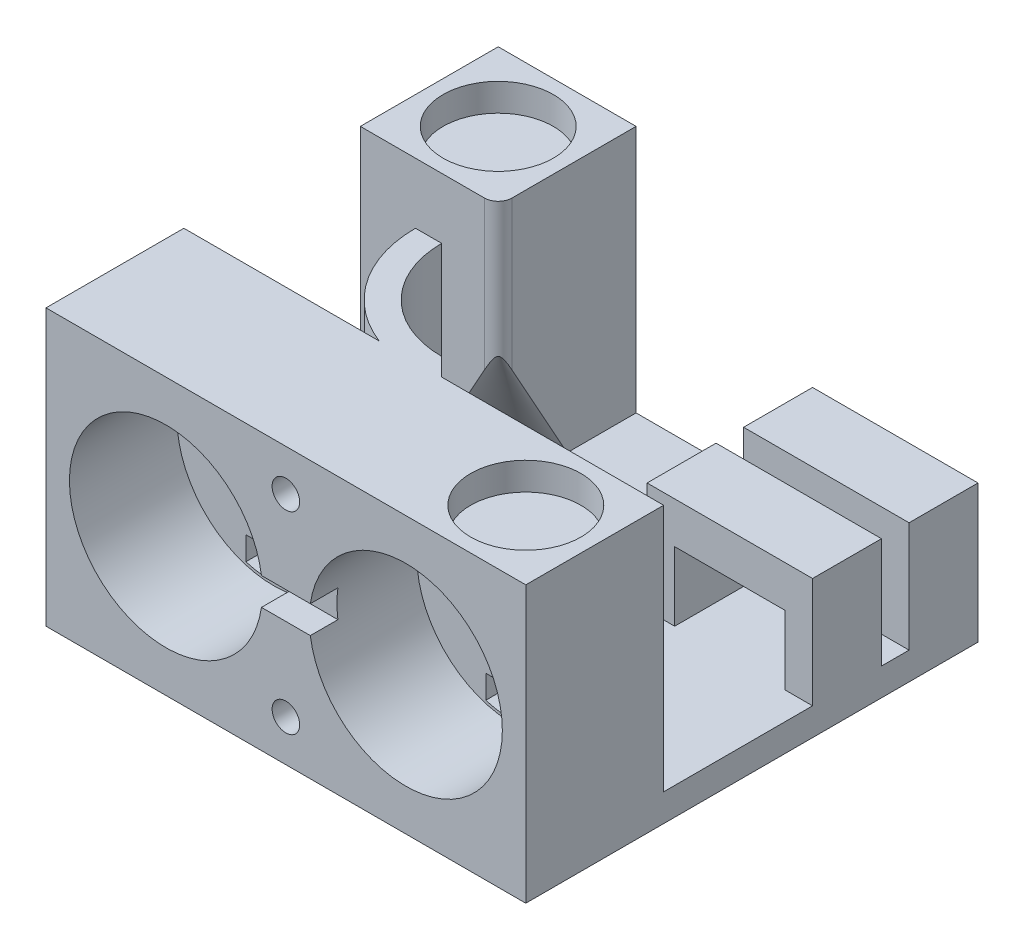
ISO-10303-21;
HEADER;
FILE_DESCRIPTION(('STEP AP214'),'2;1');
FILE_NAME('part.step','',(''),(''),'','','');
FILE_SCHEMA(('AUTOMOTIVE_DESIGN { 1 0 10303 214 1 1 1 1 }'));
ENDSEC;
DATA;
#1=APPLICATION_CONTEXT('core data for automotive mechanical design processes');
#2=APPLICATION_PROTOCOL_DEFINITION('international standard','automotive_design',2000,#1);
#3=PRODUCT_CONTEXT('',#1,'mechanical');
#4=PRODUCT('Part','Part','',(#3));
#5=PRODUCT_RELATED_PRODUCT_CATEGORY('part','',(#4));
#6=PRODUCT_DEFINITION_FORMATION('','',#4);
#7=PRODUCT_DEFINITION_CONTEXT('part definition',#1,'design');
#8=PRODUCT_DEFINITION('design','',#6,#7);
#9=PRODUCT_DEFINITION_SHAPE('','',#8);
#10=(LENGTH_UNIT() NAMED_UNIT(*) SI_UNIT(.MILLI.,.METRE.));
#11=(NAMED_UNIT(*) PLANE_ANGLE_UNIT() SI_UNIT($,.RADIAN.));
#12=(NAMED_UNIT(*) SI_UNIT($,.STERADIAN.) SOLID_ANGLE_UNIT());
#13=UNCERTAINTY_MEASURE_WITH_UNIT(LENGTH_MEASURE(1.E-05),#10,'distance_accuracy_value','');
#14=(GEOMETRIC_REPRESENTATION_CONTEXT(3) GLOBAL_UNCERTAINTY_ASSIGNED_CONTEXT((#13)) GLOBAL_UNIT_ASSIGNED_CONTEXT((#10,
#11,#12)) REPRESENTATION_CONTEXT('',''));
#15=CARTESIAN_POINT('',(0.,0.,0.));
#16=DIRECTION('',(0.,0.,1.));
#17=DIRECTION('',(1.,0.,0.));
#18=AXIS2_PLACEMENT_3D('',#15,#16,#17);
#19=CARTESIAN_POINT('',(0.,0.,2.7));
#20=DIRECTION('',(0.,0.,-1.));
#21=DIRECTION('',(-1.,0.,0.));
#22=AXIS2_PLACEMENT_3D('',#19,#20,#21);
#23=PLANE('',#22);
#24=CARTESIAN_POINT('',(-4.34999999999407,4.99999999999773,2.7));
#25=DIRECTION('',(0.,0.,-1.));
#26=DIRECTION('',(-1.,0.,0.));
#27=AXIS2_PLACEMENT_3D('',#24,#25,#26);
#28=CIRCLE('',#27,3.39999999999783);
#29=CARTESIAN_POINT('',(-5.34999999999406,1.75038463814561,2.7));
#30=VERTEX_POINT('',#29);
#31=CARTESIAN_POINT('',(-3.34999999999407,1.75038463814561,2.7));
#32=VERTEX_POINT('',#31);
#33=EDGE_CURVE('E574',#30,#32,#28,.F.);
#34=ORIENTED_EDGE('',*,*,#33,.T.);
#35=DIRECTION('',(0.,1.,0.));
#36=VECTOR('',#35,1.);
#37=CARTESIAN_POINT('',(-3.34999999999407,2.6,2.7));
#38=LINE('',#37,#36);
#39=CARTESIAN_POINT('',(-3.34999999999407,2.6,2.7));
#40=VERTEX_POINT('',#39);
#41=EDGE_CURVE('E527',#32,#40,#38,.T.);
#42=ORIENTED_EDGE('',*,*,#41,.T.);
#43=DIRECTION('',(-1.,0.,0.));
#44=VECTOR('',#43,1.);
#45=CARTESIAN_POINT('',(-5.34999999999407,2.6,2.7));
#46=LINE('',#45,#44);
#47=CARTESIAN_POINT('',(-5.34999999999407,2.6,2.7));
#48=VERTEX_POINT('',#47);
#49=EDGE_CURVE('E585',#40,#48,#46,.T.);
#50=ORIENTED_EDGE('',*,*,#49,.T.);
#51=DIRECTION('',(0.,-1.,0.));
#52=VECTOR('',#51,1.);
#53=CARTESIAN_POINT('',(-5.34999999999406,1.75038463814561,2.7));
#54=LINE('',#53,#52);
#55=EDGE_CURVE('E582',#48,#30,#54,.T.);
#56=ORIENTED_EDGE('',*,*,#55,.T.);
#57=EDGE_LOOP('',(#34,#42,#50,#56));
#58=FACE_BOUND('',#57,.T.);
#59=DIRECTION('',(-1.,0.,0.));
#60=VECTOR('',#59,1.);
#61=CARTESIAN_POINT('',(-8.7,10.,2.7));
#62=LINE('',#61,#60);
#63=CARTESIAN_POINT('',(-1.61554944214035,10.,2.7));
#64=VERTEX_POINT('',#63);
#65=CARTESIAN_POINT('',(-8.7,10.,2.7));
#66=VERTEX_POINT('',#65);
#67=EDGE_CURVE('E626',#64,#66,#62,.T.);
#68=ORIENTED_EDGE('',*,*,#67,.F.);
#69=DIRECTION('',(0.,-1.,0.));
#70=VECTOR('',#69,1.);
#71=CARTESIAN_POINT('',(-1.61554944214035,16.6454871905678,2.7));
#72=LINE('',#71,#70);
#73=CARTESIAN_POINT('',(-1.61554944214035,1.,2.7));
#74=VERTEX_POINT('',#73);
#75=EDGE_CURVE('E358',#64,#74,#72,.T.);
#76=ORIENTED_EDGE('',*,*,#75,.T.);
#77=DIRECTION('',(1.,0.,0.));
#78=VECTOR('',#77,1.);
#79=CARTESIAN_POINT('',(-8.7,1.,2.7));
#80=LINE('',#79,#78);
#81=CARTESIAN_POINT('',(-8.7,1.,2.7));
#82=VERTEX_POINT('',#81);
#83=EDGE_CURVE('E620',#82,#74,#80,.T.);
#84=ORIENTED_EDGE('',*,*,#83,.F.);
#85=DIRECTION('',(0.,-1.,0.));
#86=VECTOR('',#85,1.);
#87=CARTESIAN_POINT('',(-8.7,1.,2.7));
#88=LINE('',#87,#86);
#89=EDGE_CURVE('E616',#66,#82,#88,.T.);
#90=ORIENTED_EDGE('',*,*,#89,.F.);
#91=EDGE_LOOP('',(#68,#76,#84,#90));
#92=FACE_BOUND('',#91,.T.);
#93=ADVANCED_FACE('F43',(#58,#92),#23,.T.);
#94=CARTESIAN_POINT('',(2.69959823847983,18.4855654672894,-8.7));
#95=DIRECTION('',(1.,0.,0.));
#96=DIRECTION('',(0.,0.,-1.));
#97=AXIS2_PLACEMENT_3D('',#94,#95,#96);
#98=PLANE('',#97);
#99=DIRECTION('',(0.,0.,1.));
#100=VECTOR('',#99,1.);
#101=CARTESIAN_POINT('',(2.69959823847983,1.,-8.7));
#102=LINE('',#101,#100);
#103=CARTESIAN_POINT('',(2.69959823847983,1.,-8.7));
#104=VERTEX_POINT('',#103);
#105=CARTESIAN_POINT('',(2.69959823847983,1.,-6.2));
#106=VERTEX_POINT('',#105);
#107=EDGE_CURVE('E446',#104,#106,#102,.T.);
#108=ORIENTED_EDGE('',*,*,#107,.T.);
#109=DIRECTION('',(0.,1.,0.));
#110=VECTOR('',#109,1.);
#111=CARTESIAN_POINT('',(2.69959823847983,-5.08315882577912,-6.2));
#112=LINE('',#111,#110);
#113=CARTESIAN_POINT('',(2.69959823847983,5.,-6.2));
#114=VERTEX_POINT('',#113);
#115=EDGE_CURVE('E410',#106,#114,#112,.T.);
#116=ORIENTED_EDGE('',*,*,#115,.T.);
#117=DIRECTION('',(0.,0.,1.));
#118=VECTOR('',#117,1.);
#119=CARTESIAN_POINT('',(2.69959823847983,5.,-2.7));
#120=LINE('',#119,#118);
#121=CARTESIAN_POINT('',(2.69959823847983,5.,-8.7));
#122=VERTEX_POINT('',#121);
#123=EDGE_CURVE('E428',#122,#114,#120,.T.);
#124=ORIENTED_EDGE('',*,*,#123,.F.);
#125=DIRECTION('',(0.,-1.,0.));
#126=VECTOR('',#125,1.);
#127=CARTESIAN_POINT('',(2.69959823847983,18.4855654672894,-8.7));
#128=LINE('',#127,#126);
#129=EDGE_CURVE('E451',#122,#104,#128,.T.);
#130=ORIENTED_EDGE('',*,*,#129,.T.);
#131=EDGE_LOOP('',(#108,#116,#124,#130));
#132=FACE_BOUND('',#131,.T.);
#133=ADVANCED_FACE('F797',(#132),#98,.F.);
#134=CARTESIAN_POINT('',(-8.701,5.,-2.7));
#135=DIRECTION('',(0.,-1.,0.));
#136=DIRECTION('',(0.,0.,-1.));
#137=AXIS2_PLACEMENT_3D('',#134,#135,#136);
#138=PLANE('',#137);
#139=ORIENTED_EDGE('',*,*,#123,.T.);
#140=DIRECTION('',(-1.,0.,0.));
#141=VECTOR('',#140,1.);
#142=CARTESIAN_POINT('',(2.69959823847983,5.,-6.2));
#143=LINE('',#142,#141);
#144=CARTESIAN_POINT('',(8.7,5.,-6.2));
#145=VERTEX_POINT('',#144);
#146=EDGE_CURVE('E402',#145,#114,#143,.T.);
#147=ORIENTED_EDGE('',*,*,#146,.F.);
#148=DIRECTION('',(0.,0.,-1.));
#149=VECTOR('',#148,1.);
#150=CARTESIAN_POINT('',(8.7,5.,-2.7));
#151=LINE('',#150,#149);
#152=CARTESIAN_POINT('',(8.7,5.,-8.7));
#153=VERTEX_POINT('',#152);
#154=EDGE_CURVE('E438',#145,#153,#151,.T.);
#155=ORIENTED_EDGE('',*,*,#154,.T.);
#156=DIRECTION('',(1.,0.,0.));
#157=VECTOR('',#156,1.);
#158=CARTESIAN_POINT('',(-8.701,5.,-8.7));
#159=LINE('',#158,#157);
#160=EDGE_CURVE('E434',#122,#153,#159,.T.);
#161=ORIENTED_EDGE('',*,*,#160,.F.);
#162=EDGE_LOOP('',(#139,#147,#155,#161));
#163=FACE_BOUND('',#162,.T.);
#164=ADVANCED_FACE('F777',(#163),#138,.F.);
#165=CARTESIAN_POINT('',(0.,1.,0.));
#166=DIRECTION('',(0.,-1.,0.));
#167=DIRECTION('',(0.,0.,-1.));
#168=AXIS2_PLACEMENT_3D('',#165,#166,#167);
#169=PLANE('',#168);
#170=CARTESIAN_POINT('',(0.,1.,-1.5));
#171=DIRECTION('',(0.,1.,0.));
#172=DIRECTION('',(0.,0.,1.));
#173=AXIS2_PLACEMENT_3D('',#170,#171,#172);
#174=CIRCLE('',#173,3.55);
#175=CARTESIAN_POINT('',(-3.55,1.,-1.5));
#176=VERTEX_POINT('',#175);
#177=CARTESIAN_POINT('',(0.,1.,2.05));
#178=VERTEX_POINT('',#177);
#179=EDGE_CURVE('E345',#176,#178,#174,.T.);
#180=ORIENTED_EDGE('',*,*,#179,.T.);
#181=DIRECTION('',(0.707106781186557,0.,0.707106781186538));
#182=VECTOR('',#181,1.);
#183=CARTESIAN_POINT('',(-1.025,1.,1.02500000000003));
#184=LINE('',#183,#182);
#185=CARTESIAN_POINT('',(0.650000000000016,1.,2.7));
#186=VERTEX_POINT('',#185);
#187=EDGE_CURVE('E336',#178,#186,#184,.T.);
#188=ORIENTED_EDGE('',*,*,#187,.T.);
#189=CARTESIAN_POINT('',(8.7,1.,2.7));
#190=VERTEX_POINT('',#189);
#191=EDGE_CURVE('E619',#186,#190,#80,.T.);
#192=ORIENTED_EDGE('',*,*,#191,.T.);
#193=DIRECTION('',(0.,0.,-1.));
#194=VECTOR('',#193,1.);
#195=CARTESIAN_POINT('',(8.7,1.,8.7));
#196=LINE('',#195,#194);
#197=CARTESIAN_POINT('',(8.7,1.,-2.7));
#198=VERTEX_POINT('',#197);
#199=EDGE_CURVE('E635',#190,#198,#196,.T.);
#200=ORIENTED_EDGE('',*,*,#199,.T.);
#201=DIRECTION('',(1.,0.,0.));
#202=VECTOR('',#201,1.);
#203=CARTESIAN_POINT('',(8.7,1.,-2.7));
#204=LINE('',#203,#202);
#205=CARTESIAN_POINT('',(7.7,1.,-2.7));
#206=VERTEX_POINT('',#205);
#207=EDGE_CURVE('E445',#206,#198,#204,.T.);
#208=ORIENTED_EDGE('',*,*,#207,.F.);
#209=DIRECTION('',(0.,0.,-1.));
#210=VECTOR('',#209,1.);
#211=CARTESIAN_POINT('',(7.7,1.,2.01733126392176));
#212=LINE('',#211,#210);
#213=CARTESIAN_POINT('',(7.7,1.,-5.2));
#214=VERTEX_POINT('',#213);
#215=EDGE_CURVE('E392',#206,#214,#212,.T.);
#216=ORIENTED_EDGE('',*,*,#215,.T.);
#217=DIRECTION('',(1.,0.,0.));
#218=VECTOR('',#217,1.);
#219=CARTESIAN_POINT('',(2.69959823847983,1.,-5.2));
#220=LINE('',#219,#218);
#221=CARTESIAN_POINT('',(8.7,1.,-5.2));
#222=VERTEX_POINT('',#221);
#223=EDGE_CURVE('E419',#214,#222,#220,.T.);
#224=ORIENTED_EDGE('',*,*,#223,.T.);
#225=DIRECTION('',(0.,0.,-1.));
#226=VECTOR('',#225,1.);
#227=CARTESIAN_POINT('',(8.7,1.,-5.2));
#228=LINE('',#227,#226);
#229=CARTESIAN_POINT('',(8.7,1.,-6.2));
#230=VERTEX_POINT('',#229);
#231=EDGE_CURVE('E411',#222,#230,#228,.T.);
#232=ORIENTED_EDGE('',*,*,#231,.T.);
#233=DIRECTION('',(-1.,0.,0.));
#234=VECTOR('',#233,1.);
#235=CARTESIAN_POINT('',(2.69959823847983,1.,-6.2));
#236=LINE('',#235,#234);
#237=CARTESIAN_POINT('',(7.7,1.,-6.2));
#238=VERTEX_POINT('',#237);
#239=EDGE_CURVE('E407',#230,#238,#236,.T.);
#240=ORIENTED_EDGE('',*,*,#239,.T.);
#241=CARTESIAN_POINT('',(7.7,1.,-8.7));
#242=VERTEX_POINT('',#241);
#243=EDGE_CURVE('E381',#238,#242,#212,.T.);
#244=ORIENTED_EDGE('',*,*,#243,.T.);
#245=DIRECTION('',(-1.,0.,0.));
#246=VECTOR('',#245,1.);
#247=CARTESIAN_POINT('',(7.7,1.,-8.7));
#248=LINE('',#247,#246);
#249=CARTESIAN_POINT('',(3.69959823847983,1.,-8.7));
#250=VERTEX_POINT('',#249);
#251=EDGE_CURVE('E372',#242,#250,#248,.T.);
#252=ORIENTED_EDGE('',*,*,#251,.T.);
#253=DIRECTION('',(0.,0.,-1.));
#254=VECTOR('',#253,1.);
#255=CARTESIAN_POINT('',(3.69959823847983,1.,2.01733126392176));
#256=LINE('',#255,#254);
#257=CARTESIAN_POINT('',(3.69959823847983,1.,-6.2));
#258=VERTEX_POINT('',#257);
#259=EDGE_CURVE('E391',#258,#250,#256,.T.);
#260=ORIENTED_EDGE('',*,*,#259,.F.);
#261=EDGE_CURVE('E405',#258,#106,#236,.T.);
#262=ORIENTED_EDGE('',*,*,#261,.T.);
#263=ORIENTED_EDGE('',*,*,#107,.F.);
#264=DIRECTION('',(-1.,0.,0.));
#265=VECTOR('',#264,1.);
#266=CARTESIAN_POINT('',(-8.7,1.,-8.7));
#267=LINE('',#266,#265);
#268=CARTESIAN_POINT('',(-3.7,1.,-8.7));
#269=VERTEX_POINT('',#268);
#270=EDGE_CURVE('E638',#104,#269,#267,.T.);
#271=ORIENTED_EDGE('',*,*,#270,.T.);
#272=DIRECTION('',(0.,0.,-1.));
#273=VECTOR('',#272,1.);
#274=CARTESIAN_POINT('',(-3.7,1.,-8.7));
#275=LINE('',#274,#273);
#276=CARTESIAN_POINT('',(-3.7,1.,-6.2));
#277=VERTEX_POINT('',#276);
#278=EDGE_CURVE('E465',#277,#269,#275,.T.);
#279=ORIENTED_EDGE('',*,*,#278,.F.);
#280=CARTESIAN_POINT('',(-3.7,1.,-3.70000000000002));
#281=DIRECTION('',(0.,-1.,0.));
#282=DIRECTION('',(0.,0.,-1.));
#283=AXIS2_PLACEMENT_3D('',#280,#281,#282);
#284=CIRCLE('',#283,2.49999999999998);
#285=CARTESIAN_POINT('',(-6.19999999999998,0.999999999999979,-3.70000000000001));
#286=VERTEX_POINT('',#285);
#287=EDGE_CURVE('E462',#286,#277,#284,.T.);
#288=ORIENTED_EDGE('',*,*,#287,.F.);
#289=DIRECTION('',(1.,0.,0.));
#290=VECTOR('',#289,1.);
#291=CARTESIAN_POINT('',(-8.7,1.,-3.7));
#292=LINE('',#291,#290);
#293=CARTESIAN_POINT('',(-8.7,1.,-3.7));
#294=VERTEX_POINT('',#293);
#295=EDGE_CURVE('E469',#294,#286,#292,.T.);
#296=ORIENTED_EDGE('',*,*,#295,.F.);
#297=DIRECTION('',(0.,0.,1.));
#298=VECTOR('',#297,1.);
#299=CARTESIAN_POINT('',(-8.7,1.,8.7));
#300=LINE('',#299,#298);
#301=EDGE_CURVE('E641',#294,#82,#300,.T.);
#302=ORIENTED_EDGE('',*,*,#301,.T.);
#303=ORIENTED_EDGE('',*,*,#83,.T.);
#304=CARTESIAN_POINT('',(0.,1.,-1.5));
#305=DIRECTION('',(0.,1.,0.));
#306=DIRECTION('',(0.,0.,1.));
#307=AXIS2_PLACEMENT_3D('',#304,#305,#306);
#308=CIRCLE('',#307,4.5);
#309=CARTESIAN_POINT('',(-4.5,1.,-1.5));
#310=VERTEX_POINT('',#309);
#311=EDGE_CURVE('E59',#310,#74,#308,.T.);
#312=ORIENTED_EDGE('',*,*,#311,.F.);
#313=DIRECTION('',(1.,0.,0.));
#314=VECTOR('',#313,1.);
#315=CARTESIAN_POINT('',(0.,1.,-1.5));
#316=LINE('',#315,#314);
#317=EDGE_CURVE('E349',#310,#176,#316,.T.);
#318=ORIENTED_EDGE('',*,*,#317,.T.);
#319=EDGE_LOOP('',(#180,#188,#192,#200,#208,#216,#224,#232,#240,#244,#252,#260,#262,#263,#271,
#279,#288,#296,#302,#303,#312,#318));
#320=FACE_BOUND('',#319,.T.);
#321=CARTESIAN_POINT('',(0.,1.,-1.5));
#322=DIRECTION('',(0.,1.,0.));
#323=DIRECTION('',(0.,0.,1.));
#324=AXIS2_PLACEMENT_3D('',#321,#322,#323);
#325=CIRCLE('',#324,2.9);
#326=CARTESIAN_POINT('',(0.,1.,1.4));
#327=VERTEX_POINT('',#326);
#328=EDGE_CURVE('E488',#327,#327,#325,.T.);
#329=ORIENTED_EDGE('',*,*,#328,.F.);
#330=EDGE_LOOP('',(#329));
#331=FACE_BOUND('',#330,.T.);
#332=CARTESIAN_POINT('',(2.69959823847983,1.,-5.2));
#333=VERTEX_POINT('',#332);
#334=CARTESIAN_POINT('',(3.69959823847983,1.,-5.2));
#335=VERTEX_POINT('',#334);
#336=EDGE_CURVE('E416',#333,#335,#220,.T.);
#337=ORIENTED_EDGE('',*,*,#336,.T.);
#338=CARTESIAN_POINT('',(3.69959823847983,1.,-2.7));
#339=VERTEX_POINT('',#338);
#340=EDGE_CURVE('E389',#339,#335,#256,.T.);
#341=ORIENTED_EDGE('',*,*,#340,.F.);
#342=CARTESIAN_POINT('',(2.69959823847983,1.,-2.7));
#343=VERTEX_POINT('',#342);
#344=EDGE_CURVE('E441',#343,#339,#204,.T.);
#345=ORIENTED_EDGE('',*,*,#344,.F.);
#346=EDGE_CURVE('E450',#333,#343,#102,.T.);
#347=ORIENTED_EDGE('',*,*,#346,.F.);
#348=EDGE_LOOP('',(#337,#341,#345,#347));
#349=FACE_BOUND('',#348,.T.);
#350=ADVANCED_FACE('F773',(#320,#331,#349),#169,.F.);
#351=CARTESIAN_POINT('',(8.7,1.,8.7));
#352=DIRECTION('',(-1.,0.,0.));
#353=DIRECTION('',(0.,0.,1.));
#354=AXIS2_PLACEMENT_3D('',#351,#352,#353);
#355=PLANE('',#354);
#356=ORIENTED_EDGE('',*,*,#154,.F.);
#357=DIRECTION('',(0.,1.,0.));
#358=VECTOR('',#357,1.);
#359=CARTESIAN_POINT('',(8.7,-5.08315882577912,-6.2));
#360=LINE('',#359,#358);
#361=EDGE_CURVE('E414',#230,#145,#360,.T.);
#362=ORIENTED_EDGE('',*,*,#361,.F.);
#363=ORIENTED_EDGE('',*,*,#231,.F.);
#364=DIRECTION('',(0.,1.,0.));
#365=VECTOR('',#364,1.);
#366=CARTESIAN_POINT('',(8.7,-5.08315882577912,-5.2));
#367=LINE('',#366,#365);
#368=CARTESIAN_POINT('',(8.7,5.,-5.2));
#369=VERTEX_POINT('',#368);
#370=EDGE_CURVE('E415',#222,#369,#367,.T.);
#371=ORIENTED_EDGE('',*,*,#370,.T.);
#372=CARTESIAN_POINT('',(8.7,5.,-2.7));
#373=VERTEX_POINT('',#372);
#374=EDGE_CURVE('E435',#373,#369,#151,.T.);
#375=ORIENTED_EDGE('',*,*,#374,.F.);
#376=DIRECTION('',(0.,-1.,0.));
#377=VECTOR('',#376,1.);
#378=CARTESIAN_POINT('',(8.7,18.4855654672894,-2.7));
#379=LINE('',#378,#377);
#380=EDGE_CURVE('E431',#373,#198,#379,.T.);
#381=ORIENTED_EDGE('',*,*,#380,.T.);
#382=ORIENTED_EDGE('',*,*,#199,.F.);
#383=DIRECTION('',(0.,1.,0.));
#384=VECTOR('',#383,1.);
#385=CARTESIAN_POINT('',(8.7,1.,2.7));
#386=LINE('',#385,#384);
#387=CARTESIAN_POINT('',(8.7,10.,2.7));
#388=VERTEX_POINT('',#387);
#389=EDGE_CURVE('E623',#190,#388,#386,.T.);
#390=ORIENTED_EDGE('',*,*,#389,.T.);
#391=DIRECTION('',(0.,0.,1.));
#392=VECTOR('',#391,1.);
#393=CARTESIAN_POINT('',(8.7,10.,2.7));
#394=LINE('',#393,#392);
#395=CARTESIAN_POINT('',(8.7,10.,7.7));
#396=VERTEX_POINT('',#395);
#397=EDGE_CURVE('E628',#388,#396,#394,.T.);
#398=ORIENTED_EDGE('',*,*,#397,.T.);
#399=DIRECTION('',(0.,-1.,0.));
#400=VECTOR('',#399,1.);
#401=CARTESIAN_POINT('',(8.7,1.,7.7));
#402=LINE('',#401,#400);
#403=CARTESIAN_POINT('',(8.7,0.,7.7));
#404=VERTEX_POINT('',#403);
#405=EDGE_CURVE('E612',#396,#404,#402,.T.);
#406=ORIENTED_EDGE('',*,*,#405,.T.);
#407=DIRECTION('',(0.,0.,-1.));
#408=VECTOR('',#407,1.);
#409=CARTESIAN_POINT('',(8.7,0.,8.7));
#410=LINE('',#409,#408);
#411=CARTESIAN_POINT('',(8.7,0.,-8.7));
#412=VERTEX_POINT('',#411);
#413=EDGE_CURVE('E632',#404,#412,#410,.T.);
#414=ORIENTED_EDGE('',*,*,#413,.T.);
#415=DIRECTION('',(0.,-1.,0.));
#416=VECTOR('',#415,1.);
#417=CARTESIAN_POINT('',(8.7,1.,-8.7));
#418=LINE('',#417,#416);
#419=EDGE_CURVE('E652',#153,#412,#418,.T.);
#420=ORIENTED_EDGE('',*,*,#419,.F.);
#421=EDGE_LOOP('',(#356,#362,#363,#371,#375,#381,#382,#390,#398,#406,#414,#420));
#422=FACE_BOUND('',#421,.T.);
#423=ADVANCED_FACE('F776',(#422),#355,.F.);
#424=CARTESIAN_POINT('',(-8.7,1.,-8.7));
#425=DIRECTION('',(0.,0.,1.));
#426=DIRECTION('',(1.,0.,0.));
#427=AXIS2_PLACEMENT_3D('',#424,#425,#426);
#428=PLANE('',#427);
#429=ORIENTED_EDGE('',*,*,#251,.F.);
#430=DIRECTION('',(0.,-1.,0.));
#431=VECTOR('',#430,1.);
#432=CARTESIAN_POINT('',(7.7,1.,-8.7));
#433=LINE('',#432,#431);
#434=CARTESIAN_POINT('',(7.7,3.5,-8.7));
#435=VERTEX_POINT('',#434);
#436=EDGE_CURVE('E67',#435,#242,#433,.T.);
#437=ORIENTED_EDGE('',*,*,#436,.F.);
#438=DIRECTION('',(1.,0.,0.));
#439=VECTOR('',#438,1.);
#440=CARTESIAN_POINT('',(7.7,3.5,-8.7));
#441=LINE('',#440,#439);
#442=CARTESIAN_POINT('',(3.69959823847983,3.5,-8.7));
#443=VERTEX_POINT('',#442);
#444=EDGE_CURVE('E378',#443,#435,#441,.T.);
#445=ORIENTED_EDGE('',*,*,#444,.F.);
#446=DIRECTION('',(0.,1.,0.));
#447=VECTOR('',#446,1.);
#448=CARTESIAN_POINT('',(3.69959823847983,1.,-8.7));
#449=LINE('',#448,#447);
#450=EDGE_CURVE('E375',#250,#443,#449,.T.);
#451=ORIENTED_EDGE('',*,*,#450,.F.);
#452=EDGE_LOOP('',(#429,#437,#445,#451));
#453=FACE_BOUND('',#452,.T.);
#454=ORIENTED_EDGE('',*,*,#129,.F.);
#455=ORIENTED_EDGE('',*,*,#160,.T.);
#456=ORIENTED_EDGE('',*,*,#419,.T.);
#457=DIRECTION('',(-1.,0.,0.));
#458=VECTOR('',#457,1.);
#459=CARTESIAN_POINT('',(-8.7,0.,-8.7));
#460=LINE('',#459,#458);
#461=CARTESIAN_POINT('',(-8.7,0.,-8.7));
#462=VERTEX_POINT('',#461);
#463=EDGE_CURVE('E646',#412,#462,#460,.T.);
#464=ORIENTED_EDGE('',*,*,#463,.T.);
#465=DIRECTION('',(0.,-1.,0.));
#466=VECTOR('',#465,1.);
#467=CARTESIAN_POINT('',(-8.7,1.,-8.7));
#468=LINE('',#467,#466);
#469=CARTESIAN_POINT('',(-8.7,10.,-8.7));
#470=VERTEX_POINT('',#469);
#471=EDGE_CURVE('E643',#470,#462,#468,.T.);
#472=ORIENTED_EDGE('',*,*,#471,.F.);
#473=DIRECTION('',(-1.,0.,0.));
#474=VECTOR('',#473,1.);
#475=CARTESIAN_POINT('',(-8.7,10.,-8.7));
#476=LINE('',#475,#474);
#477=CARTESIAN_POINT('',(-3.7,10.,-8.7));
#478=VERTEX_POINT('',#477);
#479=EDGE_CURVE('E481',#478,#470,#476,.T.);
#480=ORIENTED_EDGE('',*,*,#479,.F.);
#481=DIRECTION('',(0.,-1.,0.));
#482=VECTOR('',#481,1.);
#483=CARTESIAN_POINT('',(-3.7,17.0710678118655,-8.7));
#484=LINE('',#483,#482);
#485=EDGE_CURVE('E468',#478,#269,#484,.T.);
#486=ORIENTED_EDGE('',*,*,#485,.T.);
#487=ORIENTED_EDGE('',*,*,#270,.F.);
#488=EDGE_LOOP('',(#454,#455,#456,#464,#472,#480,#486,#487));
#489=FACE_BOUND('',#488,.T.);
#490=ADVANCED_FACE('F785',(#453,#489),#428,.F.);
#491=CARTESIAN_POINT('',(-8.7,1.,8.7));
#492=DIRECTION('',(1.,0.,0.));
#493=DIRECTION('',(0.,0.,-1.));
#494=AXIS2_PLACEMENT_3D('',#491,#492,#493);
#495=PLANE('',#494);
#496=DIRECTION('',(0.,0.,1.));
#497=VECTOR('',#496,1.);
#498=CARTESIAN_POINT('',(-8.7,0.,8.7));
#499=LINE('',#498,#497);
#500=CARTESIAN_POINT('',(-8.7,0.,7.7));
#501=VERTEX_POINT('',#500);
#502=EDGE_CURVE('E639',#462,#501,#499,.T.);
#503=ORIENTED_EDGE('',*,*,#502,.T.);
#504=DIRECTION('',(0.,1.,0.));
#505=VECTOR('',#504,1.);
#506=CARTESIAN_POINT('',(-8.7,0.,7.7));
#507=LINE('',#506,#505);
#508=CARTESIAN_POINT('',(-8.7,10.,7.7));
#509=VERTEX_POINT('',#508);
#510=EDGE_CURVE('E598',#501,#509,#507,.T.);
#511=ORIENTED_EDGE('',*,*,#510,.T.);
#512=DIRECTION('',(0.,0.,1.));
#513=VECTOR('',#512,1.);
#514=CARTESIAN_POINT('',(-8.7,10.,2.7));
#515=LINE('',#514,#513);
#516=EDGE_CURVE('E629',#66,#509,#515,.T.);
#517=ORIENTED_EDGE('',*,*,#516,.F.);
#518=ORIENTED_EDGE('',*,*,#89,.T.);
#519=ORIENTED_EDGE('',*,*,#301,.F.);
#520=DIRECTION('',(0.,-1.,0.));
#521=VECTOR('',#520,1.);
#522=CARTESIAN_POINT('',(-8.7,17.0710678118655,-3.7));
#523=LINE('',#522,#521);
#524=CARTESIAN_POINT('',(-8.7,10.,-3.7));
#525=VERTEX_POINT('',#524);
#526=EDGE_CURVE('E464',#525,#294,#523,.T.);
#527=ORIENTED_EDGE('',*,*,#526,.F.);
#528=DIRECTION('',(0.,0.,1.));
#529=VECTOR('',#528,1.);
#530=CARTESIAN_POINT('',(-8.7,10.,-8.7));
#531=LINE('',#530,#529);
#532=EDGE_CURVE('E478',#470,#525,#531,.T.);
#533=ORIENTED_EDGE('',*,*,#532,.F.);
#534=ORIENTED_EDGE('',*,*,#471,.T.);
#535=EDGE_LOOP('',(#503,#511,#517,#518,#519,#527,#533,#534));
#536=FACE_BOUND('',#535,.T.);
#537=ADVANCED_FACE('F781',(#536),#495,.F.);
#538=CARTESIAN_POINT('',(0.,0.,0.));
#539=DIRECTION('',(0.,-1.,0.));
#540=DIRECTION('',(0.,0.,-1.));
#541=AXIS2_PLACEMENT_3D('',#538,#539,#540);
#542=PLANE('',#541);
#543=CARTESIAN_POINT('',(0.,0.,-1.5));
#544=DIRECTION('',(0.,-1.,0.));
#545=DIRECTION('',(0.,0.,-1.));
#546=AXIS2_PLACEMENT_3D('',#543,#544,#545);
#547=CIRCLE('',#546,2.9);
#548=CARTESIAN_POINT('',(0.,0.,-4.4));
#549=VERTEX_POINT('',#548);
#550=EDGE_CURVE('E474',#549,#549,#547,.F.);
#551=ORIENTED_EDGE('',*,*,#550,.T.);
#552=EDGE_LOOP('',(#551));
#553=FACE_BOUND('',#552,.T.);
#554=DIRECTION('',(1.,0.,0.));
#555=VECTOR('',#554,1.);
#556=CARTESIAN_POINT('',(-8.7,0.,7.7));
#557=LINE('',#556,#555);
#558=EDGE_CURVE('E609',#501,#404,#557,.T.);
#559=ORIENTED_EDGE('',*,*,#558,.F.);
#560=ORIENTED_EDGE('',*,*,#502,.F.);
#561=ORIENTED_EDGE('',*,*,#463,.F.);
#562=ORIENTED_EDGE('',*,*,#413,.F.);
#563=EDGE_LOOP('',(#559,#560,#561,#562));
#564=FACE_BOUND('',#563,.T.);
#565=ADVANCED_FACE('F771',(#553,#564),#542,.T.);
#566=CARTESIAN_POINT('',(-8.7,10.,2.7));
#567=DIRECTION('',(0.,1.,0.));
#568=DIRECTION('',(0.,0.,1.));
#569=AXIS2_PLACEMENT_3D('',#566,#567,#568);
#570=PLANE('',#569);
#571=CARTESIAN_POINT('',(6.20000000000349,10.,5.20000000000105));
#572=DIRECTION('',(0.,1.,0.));
#573=DIRECTION('',(0.,0.,1.));
#574=AXIS2_PLACEMENT_3D('',#571,#572,#573);
#575=CIRCLE('',#574,2.);
#576=CARTESIAN_POINT('',(6.20000000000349,10.,7.20000000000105));
#577=VERTEX_POINT('',#576);
#578=EDGE_CURVE('E830',#577,#577,#575,.T.);
#579=ORIENTED_EDGE('',*,*,#578,.F.);
#580=EDGE_LOOP('',(#579));
#581=FACE_BOUND('',#580,.T.);
#582=DIRECTION('',(1.,0.,0.));
#583=VECTOR('',#582,1.);
#584=CARTESIAN_POINT('',(-8.7,10.,7.7));
#585=LINE('',#584,#583);
#586=EDGE_CURVE('E610',#509,#396,#585,.T.);
#587=ORIENTED_EDGE('',*,*,#586,.T.);
#588=ORIENTED_EDGE('',*,*,#397,.F.);
#589=CARTESIAN_POINT('',(0.650000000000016,10.,2.7));
#590=VERTEX_POINT('',#589);
#591=EDGE_CURVE('E327',#388,#590,#62,.T.);
#592=ORIENTED_EDGE('',*,*,#591,.T.);
#593=DIRECTION('',(0.707106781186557,0.,0.707106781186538));
#594=VECTOR('',#593,1.);
#595=CARTESIAN_POINT('',(-1.025,10.,1.02500000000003));
#596=LINE('',#595,#594);
#597=CARTESIAN_POINT('',(0.,10.,2.05));
#598=VERTEX_POINT('',#597);
#599=EDGE_CURVE('E319',#598,#590,#596,.T.);
#600=ORIENTED_EDGE('',*,*,#599,.F.);
#601=CARTESIAN_POINT('',(0.,10.,-1.5));
#602=DIRECTION('',(0.,1.,0.));
#603=DIRECTION('',(0.,0.,1.));
#604=AXIS2_PLACEMENT_3D('',#601,#602,#603);
#605=CIRCLE('',#604,3.55);
#606=CARTESIAN_POINT('',(-3.55,10.,-1.5));
#607=VERTEX_POINT('',#606);
#608=EDGE_CURVE('E324',#607,#598,#605,.T.);
#609=ORIENTED_EDGE('',*,*,#608,.F.);
#610=DIRECTION('',(1.,0.,0.));
#611=VECTOR('',#610,1.);
#612=CARTESIAN_POINT('',(0.,10.,-1.5));
#613=LINE('',#612,#611);
#614=CARTESIAN_POINT('',(-4.5,10.,-1.5));
#615=VERTEX_POINT('',#614);
#616=EDGE_CURVE('E351',#615,#607,#613,.T.);
#617=ORIENTED_EDGE('',*,*,#616,.F.);
#618=CARTESIAN_POINT('',(0.,10.,-1.5));
#619=DIRECTION('',(0.,1.,0.));
#620=DIRECTION('',(0.,0.,1.));
#621=AXIS2_PLACEMENT_3D('',#618,#619,#620);
#622=CIRCLE('',#621,4.5);
#623=EDGE_CURVE('E353',#615,#64,#622,.T.);
#624=ORIENTED_EDGE('',*,*,#623,.T.);
#625=ORIENTED_EDGE('',*,*,#67,.T.);
#626=ORIENTED_EDGE('',*,*,#516,.T.);
#627=EDGE_LOOP('',(#587,#588,#592,#600,#609,#617,#624,#625,#626));
#628=FACE_BOUND('',#627,.T.);
#629=ADVANCED_FACE('F322',(#581,#628),#570,.T.);
#630=DIRECTION('',(0.,-1.,0.));
#631=VECTOR('',#630,1.);
#632=CARTESIAN_POINT('',(0.650000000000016,16.6454871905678,2.7));
#633=LINE('',#632,#631);
#634=EDGE_CURVE('E330',#590,#186,#633,.T.);
#635=ORIENTED_EDGE('',*,*,#634,.F.);
#636=ORIENTED_EDGE('',*,*,#591,.F.);
#637=ORIENTED_EDGE('',*,*,#389,.F.);
#638=ORIENTED_EDGE('',*,*,#191,.F.);
#639=EDGE_LOOP('',(#635,#636,#637,#638));
#640=FACE_BOUND('',#639,.T.);
#641=CARTESIAN_POINT('',(4.34999999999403,4.99999999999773,2.7));
#642=DIRECTION('',(0.,0.,-1.));
#643=DIRECTION('',(-1.,0.,0.));
#644=AXIS2_PLACEMENT_3D('',#641,#642,#643);
#645=CIRCLE('',#644,3.39999999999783);
#646=CARTESIAN_POINT('',(3.34999999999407,1.75038463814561,2.7));
#647=VERTEX_POINT('',#646);
#648=CARTESIAN_POINT('',(5.34999999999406,1.75038463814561,2.7));
#649=VERTEX_POINT('',#648);
#650=EDGE_CURVE('E544',#647,#649,#645,.F.);
#651=ORIENTED_EDGE('',*,*,#650,.T.);
#652=DIRECTION('',(0.,1.,0.));
#653=VECTOR('',#652,1.);
#654=CARTESIAN_POINT('',(5.34999999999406,1.75038463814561,2.7));
#655=LINE('',#654,#653);
#656=CARTESIAN_POINT('',(5.34999999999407,2.6,2.7));
#657=VERTEX_POINT('',#656);
#658=EDGE_CURVE('E561',#649,#657,#655,.T.);
#659=ORIENTED_EDGE('',*,*,#658,.T.);
#660=DIRECTION('',(-1.,0.,0.));
#661=VECTOR('',#660,1.);
#662=CARTESIAN_POINT('',(5.34999999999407,2.6,2.7));
#663=LINE('',#662,#661);
#664=CARTESIAN_POINT('',(3.34999999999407,2.6,2.7));
#665=VERTEX_POINT('',#664);
#666=EDGE_CURVE('E538',#657,#665,#663,.T.);
#667=ORIENTED_EDGE('',*,*,#666,.T.);
#668=DIRECTION('',(0.,-1.,0.));
#669=VECTOR('',#668,1.);
#670=CARTESIAN_POINT('',(3.34999999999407,2.6,2.7));
#671=LINE('',#670,#669);
#672=EDGE_CURVE('E541',#665,#647,#671,.T.);
#673=ORIENTED_EDGE('',*,*,#672,.T.);
#674=EDGE_LOOP('',(#651,#659,#667,#673));
#675=FACE_BOUND('',#674,.T.);
#676=ADVANCED_FACE('F764',(#640,#675),#23,.T.);
#677=CARTESIAN_POINT('',(-8.7,0.,7.7));
#678=DIRECTION('',(0.,0.,-1.));
#679=DIRECTION('',(-1.,0.,0.));
#680=AXIS2_PLACEMENT_3D('',#677,#678,#679);
#681=PLANE('',#680);
#682=CARTESIAN_POINT('',(0.,8.49999999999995,7.7));
#683=DIRECTION('',(0.,0.,1.));
#684=DIRECTION('',(1.,0.,0.));
#685=AXIS2_PLACEMENT_3D('',#682,#683,#684);
#686=CIRCLE('',#685,0.5);
#687=CARTESIAN_POINT('',(0.5,8.49999999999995,7.7));
#688=VERTEX_POINT('',#687);
#689=EDGE_CURVE('E494',#688,#688,#686,.T.);
#690=ORIENTED_EDGE('',*,*,#689,.F.);
#691=EDGE_LOOP('',(#690));
#692=FACE_BOUND('',#691,.T.);
#693=CARTESIAN_POINT('',(0.,1.50000000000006,7.7));
#694=DIRECTION('',(0.,0.,1.));
#695=DIRECTION('',(1.,0.,0.));
#696=AXIS2_PLACEMENT_3D('',#693,#694,#695);
#697=CIRCLE('',#696,0.5);
#698=CARTESIAN_POINT('',(0.5,1.50000000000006,7.7));
#699=VERTEX_POINT('',#698);
#700=EDGE_CURVE('E491',#699,#699,#697,.T.);
#701=ORIENTED_EDGE('',*,*,#700,.F.);
#702=EDGE_LOOP('',(#701));
#703=FACE_BOUND('',#702,.T.);
#704=CARTESIAN_POINT('',(4.35,5.,7.7));
#705=DIRECTION('',(0.,0.,1.));
#706=DIRECTION('',(1.,0.,0.));
#707=AXIS2_PLACEMENT_3D('',#704,#705,#706);
#708=CIRCLE('',#707,3.5);
#709=CARTESIAN_POINT('',(0.885898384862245,4.5,7.7));
#710=VERTEX_POINT('',#709);
#711=CARTESIAN_POINT('',(0.885898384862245,5.5,7.7));
#712=VERTEX_POINT('',#711);
#713=EDGE_CURVE('E599',#710,#712,#708,.T.);
#714=ORIENTED_EDGE('',*,*,#713,.F.);
#715=DIRECTION('',(1.,0.,0.));
#716=VECTOR('',#715,1.);
#717=CARTESIAN_POINT('',(-0.885898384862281,4.5,7.7));
#718=LINE('',#717,#716);
#719=CARTESIAN_POINT('',(-0.885898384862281,4.5,7.7));
#720=VERTEX_POINT('',#719);
#721=EDGE_CURVE('E510',#720,#710,#718,.T.);
#722=ORIENTED_EDGE('',*,*,#721,.F.);
#723=CARTESIAN_POINT('',(-4.35000000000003,5.,7.7));
#724=DIRECTION('',(0.,0.,1.));
#725=DIRECTION('',(-1.,0.,0.));
#726=AXIS2_PLACEMENT_3D('',#723,#724,#725);
#727=CIRCLE('',#726,3.5);
#728=CARTESIAN_POINT('',(-0.885898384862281,5.5,7.7));
#729=VERTEX_POINT('',#728);
#730=EDGE_CURVE('E602',#729,#720,#727,.T.);
#731=ORIENTED_EDGE('',*,*,#730,.F.);
#732=DIRECTION('',(-1.,0.,0.));
#733=VECTOR('',#732,1.);
#734=CARTESIAN_POINT('',(-0.885898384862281,5.5,7.7));
#735=LINE('',#734,#733);
#736=EDGE_CURVE('E497',#712,#729,#735,.T.);
#737=ORIENTED_EDGE('',*,*,#736,.F.);
#738=EDGE_LOOP('',(#714,#722,#731,#737));
#739=FACE_BOUND('',#738,.T.);
#740=ORIENTED_EDGE('',*,*,#586,.F.);
#741=ORIENTED_EDGE('',*,*,#510,.F.);
#742=ORIENTED_EDGE('',*,*,#558,.T.);
#743=ORIENTED_EDGE('',*,*,#405,.F.);
#744=EDGE_LOOP('',(#740,#741,#742,#743));
#745=FACE_BOUND('',#744,.T.);
#746=ADVANCED_FACE('F757',(#692,#703,#739,#745),#681,.F.);
#747=CARTESIAN_POINT('',(-4.35000000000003,5.,3.8));
#748=DIRECTION('',(0.,0.,1.));
#749=DIRECTION('',(1.,0.,0.));
#750=AXIS2_PLACEMENT_3D('',#747,#748,#749);
#751=CYLINDRICAL_SURFACE('',#750,3.5);
#752=ORIENTED_EDGE('',*,*,#730,.T.);
#753=DIRECTION('',(0.,0.,1.));
#754=VECTOR('',#753,1.);
#755=CARTESIAN_POINT('',(-0.885898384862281,4.5,6.7));
#756=LINE('',#755,#754);
#757=CARTESIAN_POINT('',(-0.885898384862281,4.5,6.7));
#758=VERTEX_POINT('',#757);
#759=EDGE_CURVE('E519',#758,#720,#756,.T.);
#760=ORIENTED_EDGE('',*,*,#759,.F.);
#761=CARTESIAN_POINT('',(-4.35000000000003,5.,6.7));
#762=DIRECTION('',(0.,0.,-1.));
#763=DIRECTION('',(-1.,0.,0.));
#764=AXIS2_PLACEMENT_3D('',#761,#762,#763);
#765=CIRCLE('',#764,3.5);
#766=CARTESIAN_POINT('',(-0.885898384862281,5.5,6.7));
#767=VERTEX_POINT('',#766);
#768=EDGE_CURVE('E518',#758,#767,#765,.F.);
#769=ORIENTED_EDGE('',*,*,#768,.T.);
#770=DIRECTION('',(0.,0.,1.));
#771=VECTOR('',#770,1.);
#772=CARTESIAN_POINT('',(-0.885898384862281,5.5,6.7));
#773=LINE('',#772,#771);
#774=EDGE_CURVE('E521',#767,#729,#773,.T.);
#775=ORIENTED_EDGE('',*,*,#774,.T.);
#776=EDGE_LOOP('',(#752,#760,#769,#775));
#777=FACE_BOUND('',#776,.T.);
#778=CARTESIAN_POINT('',(-4.35000000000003,5.,3.8));
#779=DIRECTION('',(0.,0.,1.));
#780=DIRECTION('',(-1.,0.,0.));
#781=AXIS2_PLACEMENT_3D('',#778,#779,#780);
#782=CIRCLE('',#781,3.5);
#783=CARTESIAN_POINT('',(-7.85000000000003,5.,3.8));
#784=VERTEX_POINT('',#783);
#785=EDGE_CURVE('E564',#784,#784,#782,.T.);
#786=ORIENTED_EDGE('',*,*,#785,.F.);
#787=EDGE_LOOP('',(#786));
#788=FACE_BOUND('',#787,.T.);
#789=ADVANCED_FACE('F754',(#777,#788),#751,.F.);
#790=CARTESIAN_POINT('',(-4.35000000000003,5.,3.8));
#791=DIRECTION('',(0.,0.,-1.));
#792=DIRECTION('',(-1.,0.,0.));
#793=AXIS2_PLACEMENT_3D('',#790,#791,#792);
#794=PLANE('',#793);
#795=DIRECTION('',(0.,1.,0.));
#796=VECTOR('',#795,1.);
#797=CARTESIAN_POINT('',(-3.34999999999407,2.6,3.8));
#798=LINE('',#797,#796);
#799=CARTESIAN_POINT('',(-3.34999999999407,1.75038463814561,3.8));
#800=VERTEX_POINT('',#799);
#801=CARTESIAN_POINT('',(-3.34999999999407,2.6,3.8));
#802=VERTEX_POINT('',#801);
#803=EDGE_CURVE('E567',#800,#802,#798,.T.);
#804=ORIENTED_EDGE('',*,*,#803,.F.);
#805=CARTESIAN_POINT('',(-4.34999999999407,4.99999999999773,3.8));
#806=DIRECTION('',(0.,0.,-1.));
#807=DIRECTION('',(-1.,0.,0.));
#808=AXIS2_PLACEMENT_3D('',#805,#806,#807);
#809=CIRCLE('',#808,3.39999999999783);
#810=CARTESIAN_POINT('',(-5.34999999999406,1.75038463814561,3.8));
#811=VERTEX_POINT('',#810);
#812=EDGE_CURVE('E588',#811,#800,#809,.F.);
#813=ORIENTED_EDGE('',*,*,#812,.F.);
#814=DIRECTION('',(0.,-1.,0.));
#815=VECTOR('',#814,1.);
#816=CARTESIAN_POINT('',(-5.34999999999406,1.75038463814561,3.8));
#817=LINE('',#816,#815);
#818=CARTESIAN_POINT('',(-5.34999999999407,2.6,3.8));
#819=VERTEX_POINT('',#818);
#820=EDGE_CURVE('E590',#819,#811,#817,.T.);
#821=ORIENTED_EDGE('',*,*,#820,.F.);
#822=DIRECTION('',(-1.,0.,0.));
#823=VECTOR('',#822,1.);
#824=CARTESIAN_POINT('',(-5.34999999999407,2.6,3.8));
#825=LINE('',#824,#823);
#826=EDGE_CURVE('E532',#802,#819,#825,.T.);
#827=ORIENTED_EDGE('',*,*,#826,.F.);
#828=EDGE_LOOP('',(#804,#813,#821,#827));
#829=FACE_BOUND('',#828,.T.);
#830=ORIENTED_EDGE('',*,*,#785,.T.);
#831=EDGE_LOOP('',(#830));
#832=FACE_BOUND('',#831,.T.);
#833=ADVANCED_FACE('F752',(#829,#832),#794,.F.);
#834=CARTESIAN_POINT('',(4.35,5.,3.8));
#835=DIRECTION('',(0.,0.,1.));
#836=DIRECTION('',(1.,0.,0.));
#837=AXIS2_PLACEMENT_3D('',#834,#835,#836);
#838=CYLINDRICAL_SURFACE('',#837,3.5);
#839=CARTESIAN_POINT('',(4.35,5.,3.8));
#840=DIRECTION('',(0.,0.,1.));
#841=DIRECTION('',(1.,0.,0.));
#842=AXIS2_PLACEMENT_3D('',#839,#840,#841);
#843=CIRCLE('',#842,3.5);
#844=CARTESIAN_POINT('',(7.85,5.,3.8));
#845=VERTEX_POINT('',#844);
#846=EDGE_CURVE('E595',#845,#845,#843,.T.);
#847=ORIENTED_EDGE('',*,*,#846,.F.);
#848=EDGE_LOOP('',(#847));
#849=FACE_BOUND('',#848,.T.);
#850=CARTESIAN_POINT('',(4.35,5.,6.7));
#851=DIRECTION('',(0.,0.,-1.));
#852=DIRECTION('',(-1.,0.,0.));
#853=AXIS2_PLACEMENT_3D('',#850,#851,#852);
#854=CIRCLE('',#853,3.5);
#855=CARTESIAN_POINT('',(0.885898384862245,5.5,6.7));
#856=VERTEX_POINT('',#855);
#857=CARTESIAN_POINT('',(0.885898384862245,4.5,6.7));
#858=VERTEX_POINT('',#857);
#859=EDGE_CURVE('E654',#856,#858,#854,.F.);
#860=ORIENTED_EDGE('',*,*,#859,.T.);
#861=DIRECTION('',(0.,0.,1.));
#862=VECTOR('',#861,1.);
#863=CARTESIAN_POINT('',(0.885898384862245,4.5,6.7));
#864=LINE('',#863,#862);
#865=EDGE_CURVE('E515',#858,#710,#864,.T.);
#866=ORIENTED_EDGE('',*,*,#865,.T.);
#867=ORIENTED_EDGE('',*,*,#713,.T.);
#868=DIRECTION('',(0.,0.,1.));
#869=VECTOR('',#868,1.);
#870=CARTESIAN_POINT('',(0.885898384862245,5.5,6.7));
#871=LINE('',#870,#869);
#872=EDGE_CURVE('E512',#856,#712,#871,.T.);
#873=ORIENTED_EDGE('',*,*,#872,.F.);
#874=EDGE_LOOP('',(#860,#866,#867,#873));
#875=FACE_BOUND('',#874,.T.);
#876=ADVANCED_FACE('F748',(#849,#875),#838,.F.);
#877=CARTESIAN_POINT('',(4.35,5.,3.8));
#878=DIRECTION('',(0.,0.,1.));
#879=DIRECTION('',(1.,0.,0.));
#880=AXIS2_PLACEMENT_3D('',#877,#878,#879);
#881=PLANE('',#880);
#882=CARTESIAN_POINT('',(4.34999999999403,4.99999999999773,3.8));
#883=DIRECTION('',(0.,0.,1.));
#884=DIRECTION('',(1.,0.,0.));
#885=AXIS2_PLACEMENT_3D('',#882,#883,#884);
#886=CIRCLE('',#885,3.39999999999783);
#887=CARTESIAN_POINT('',(5.34999999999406,1.75038463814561,3.8));
#888=VERTEX_POINT('',#887);
#889=CARTESIAN_POINT('',(3.34999999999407,1.75038463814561,3.8));
#890=VERTEX_POINT('',#889);
#891=EDGE_CURVE('E535',#888,#890,#886,.F.);
#892=ORIENTED_EDGE('',*,*,#891,.T.);
#893=DIRECTION('',(0.,1.,0.));
#894=VECTOR('',#893,1.);
#895=CARTESIAN_POINT('',(3.34999999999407,2.6,3.8));
#896=LINE('',#895,#894);
#897=CARTESIAN_POINT('',(3.34999999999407,2.6,3.8));
#898=VERTEX_POINT('',#897);
#899=EDGE_CURVE('E531',#890,#898,#896,.T.);
#900=ORIENTED_EDGE('',*,*,#899,.T.);
#901=DIRECTION('',(1.,0.,0.));
#902=VECTOR('',#901,1.);
#903=CARTESIAN_POINT('',(5.34999999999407,2.6,3.8));
#904=LINE('',#903,#902);
#905=CARTESIAN_POINT('',(5.34999999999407,2.6,3.8));
#906=VERTEX_POINT('',#905);
#907=EDGE_CURVE('E528',#898,#906,#904,.T.);
#908=ORIENTED_EDGE('',*,*,#907,.T.);
#909=DIRECTION('',(0.,-1.,0.));
#910=VECTOR('',#909,1.);
#911=CARTESIAN_POINT('',(5.34999999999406,1.75038463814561,3.8));
#912=LINE('',#911,#910);
#913=EDGE_CURVE('E551',#906,#888,#912,.T.);
#914=ORIENTED_EDGE('',*,*,#913,.T.);
#915=EDGE_LOOP('',(#892,#900,#908,#914));
#916=FACE_BOUND('',#915,.T.);
#917=ORIENTED_EDGE('',*,*,#846,.T.);
#918=EDGE_LOOP('',(#917));
#919=FACE_BOUND('',#918,.T.);
#920=ADVANCED_FACE('F730',(#916,#919),#881,.T.);
#921=CARTESIAN_POINT('',(4.34999999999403,4.99999999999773,-8.701));
#922=DIRECTION('',(0.,0.,1.));
#923=DIRECTION('',(1.,0.,0.));
#924=AXIS2_PLACEMENT_3D('',#921,#922,#923);
#925=CYLINDRICAL_SURFACE('',#924,3.39999999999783);
#926=DIRECTION('',(0.,0.,1.));
#927=VECTOR('',#926,1.);
#928=CARTESIAN_POINT('',(3.34999999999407,1.75038463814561,-8.701));
#929=LINE('',#928,#927);
#930=EDGE_CURVE('E548',#647,#890,#929,.T.);
#931=ORIENTED_EDGE('',*,*,#930,.T.);
#932=ORIENTED_EDGE('',*,*,#891,.F.);
#933=DIRECTION('',(0.,0.,1.));
#934=VECTOR('',#933,1.);
#935=CARTESIAN_POINT('',(5.34999999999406,1.75038463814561,-8.701));
#936=LINE('',#935,#934);
#937=EDGE_CURVE('E547',#649,#888,#936,.T.);
#938=ORIENTED_EDGE('',*,*,#937,.F.);
#939=ORIENTED_EDGE('',*,*,#650,.F.);
#940=EDGE_LOOP('',(#931,#932,#938,#939));
#941=FACE_BOUND('',#940,.T.);
#942=ADVANCED_FACE('F718',(#941),#925,.F.);
#943=CARTESIAN_POINT('',(3.34999999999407,2.6,-8.701));
#944=DIRECTION('',(-1.,0.,0.));
#945=DIRECTION('',(0.,-1.,0.));
#946=AXIS2_PLACEMENT_3D('',#943,#944,#945);
#947=PLANE('',#946);
#948=DIRECTION('',(0.,0.,1.));
#949=VECTOR('',#948,1.);
#950=CARTESIAN_POINT('',(3.34999999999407,2.6,-8.701));
#951=LINE('',#950,#949);
#952=EDGE_CURVE('E552',#665,#898,#951,.T.);
#953=ORIENTED_EDGE('',*,*,#952,.T.);
#954=ORIENTED_EDGE('',*,*,#899,.F.);
#955=ORIENTED_EDGE('',*,*,#930,.F.);
#956=ORIENTED_EDGE('',*,*,#672,.F.);
#957=EDGE_LOOP('',(#953,#954,#955,#956));
#958=FACE_BOUND('',#957,.T.);
#959=ADVANCED_FACE('F714',(#958),#947,.F.);
#960=CARTESIAN_POINT('',(5.34999999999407,2.6,-8.701));
#961=DIRECTION('',(0.,1.,0.));
#962=DIRECTION('',(-1.,0.,0.));
#963=AXIS2_PLACEMENT_3D('',#960,#961,#962);
#964=PLANE('',#963);
#965=DIRECTION('',(0.,0.,1.));
#966=VECTOR('',#965,1.);
#967=CARTESIAN_POINT('',(5.34999999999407,2.6,-8.701));
#968=LINE('',#967,#966);
#969=EDGE_CURVE('E555',#657,#906,#968,.T.);
#970=ORIENTED_EDGE('',*,*,#969,.T.);
#971=ORIENTED_EDGE('',*,*,#907,.F.);
#972=ORIENTED_EDGE('',*,*,#952,.F.);
#973=ORIENTED_EDGE('',*,*,#666,.F.);
#974=EDGE_LOOP('',(#970,#971,#972,#973));
#975=FACE_BOUND('',#974,.T.);
#976=ADVANCED_FACE('F717',(#975),#964,.F.);
#977=CARTESIAN_POINT('',(5.34999999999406,1.75038463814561,-8.701));
#978=DIRECTION('',(1.,0.,0.));
#979=DIRECTION('',(0.,1.,0.));
#980=AXIS2_PLACEMENT_3D('',#977,#978,#979);
#981=PLANE('',#980);
#982=ORIENTED_EDGE('',*,*,#937,.T.);
#983=ORIENTED_EDGE('',*,*,#913,.F.);
#984=ORIENTED_EDGE('',*,*,#969,.F.);
#985=ORIENTED_EDGE('',*,*,#658,.F.);
#986=EDGE_LOOP('',(#982,#983,#984,#985));
#987=FACE_BOUND('',#986,.T.);
#988=ADVANCED_FACE('F722',(#987),#981,.F.);
#989=CARTESIAN_POINT('',(-4.34999999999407,4.99999999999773,-8.701));
#990=DIRECTION('',(0.,0.,1.));
#991=DIRECTION('',(1.,0.,0.));
#992=AXIS2_PLACEMENT_3D('',#989,#990,#991);
#993=CYLINDRICAL_SURFACE('',#992,3.39999999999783);
#994=DIRECTION('',(0.,0.,1.));
#995=VECTOR('',#994,1.);
#996=CARTESIAN_POINT('',(-5.34999999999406,1.75038463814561,-8.701));
#997=LINE('',#996,#995);
#998=EDGE_CURVE('E570',#30,#811,#997,.T.);
#999=ORIENTED_EDGE('',*,*,#998,.T.);
#1000=ORIENTED_EDGE('',*,*,#812,.T.);
#1001=DIRECTION('',(0.,0.,1.));
#1002=VECTOR('',#1001,1.);
#1003=CARTESIAN_POINT('',(-3.34999999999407,1.75038463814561,-8.701));
#1004=LINE('',#1003,#1002);
#1005=EDGE_CURVE('E571',#32,#800,#1004,.T.);
#1006=ORIENTED_EDGE('',*,*,#1005,.F.);
#1007=ORIENTED_EDGE('',*,*,#33,.F.);
#1008=EDGE_LOOP('',(#999,#1000,#1006,#1007));
#1009=FACE_BOUND('',#1008,.T.);
#1010=ADVANCED_FACE('F726',(#1009),#993,.F.);
#1011=CARTESIAN_POINT('',(-5.34999999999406,1.75038463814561,-8.701));
#1012=DIRECTION('',(-1.,0.,0.));
#1013=DIRECTION('',(0.,-1.,0.));
#1014=AXIS2_PLACEMENT_3D('',#1011,#1012,#1013);
#1015=PLANE('',#1014);
#1016=DIRECTION('',(0.,0.,1.));
#1017=VECTOR('',#1016,1.);
#1018=CARTESIAN_POINT('',(-5.34999999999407,2.6,-8.701));
#1019=LINE('',#1018,#1017);
#1020=EDGE_CURVE('E577',#48,#819,#1019,.T.);
#1021=ORIENTED_EDGE('',*,*,#1020,.T.);
#1022=ORIENTED_EDGE('',*,*,#820,.T.);
#1023=ORIENTED_EDGE('',*,*,#998,.F.);
#1024=ORIENTED_EDGE('',*,*,#55,.F.);
#1025=EDGE_LOOP('',(#1021,#1022,#1023,#1024));
#1026=FACE_BOUND('',#1025,.T.);
#1027=ADVANCED_FACE('F734',(#1026),#1015,.F.);
#1028=CARTESIAN_POINT('',(-5.34999999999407,2.6,-8.701));
#1029=DIRECTION('',(0.,1.,0.));
#1030=DIRECTION('',(-1.,0.,0.));
#1031=AXIS2_PLACEMENT_3D('',#1028,#1029,#1030);
#1032=PLANE('',#1031);
#1033=DIRECTION('',(0.,0.,1.));
#1034=VECTOR('',#1033,1.);
#1035=CARTESIAN_POINT('',(-3.34999999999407,2.6,-8.701));
#1036=LINE('',#1035,#1034);
#1037=EDGE_CURVE('E575',#40,#802,#1036,.T.);
#1038=ORIENTED_EDGE('',*,*,#1037,.T.);
#1039=ORIENTED_EDGE('',*,*,#826,.T.);
#1040=ORIENTED_EDGE('',*,*,#1020,.F.);
#1041=ORIENTED_EDGE('',*,*,#49,.F.);
#1042=EDGE_LOOP('',(#1038,#1039,#1040,#1041));
#1043=FACE_BOUND('',#1042,.T.);
#1044=ADVANCED_FACE('F738',(#1043),#1032,.F.);
#1045=CARTESIAN_POINT('',(-3.34999999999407,2.6,-8.701));
#1046=DIRECTION('',(1.,0.,0.));
#1047=DIRECTION('',(0.,1.,0.));
#1048=AXIS2_PLACEMENT_3D('',#1045,#1046,#1047);
#1049=PLANE('',#1048);
#1050=ORIENTED_EDGE('',*,*,#1005,.T.);
#1051=ORIENTED_EDGE('',*,*,#803,.T.);
#1052=ORIENTED_EDGE('',*,*,#1037,.F.);
#1053=ORIENTED_EDGE('',*,*,#41,.F.);
#1054=EDGE_LOOP('',(#1050,#1051,#1052,#1053));
#1055=FACE_BOUND('',#1054,.T.);
#1056=ADVANCED_FACE('F706',(#1055),#1049,.F.);
#1057=CARTESIAN_POINT('',(0.,0.,6.7));
#1058=DIRECTION('',(0.,0.,-1.));
#1059=DIRECTION('',(-1.,0.,0.));
#1060=AXIS2_PLACEMENT_3D('',#1057,#1058,#1059);
#1061=PLANE('',#1060);
#1062=DIRECTION('',(1.,0.,0.));
#1063=VECTOR('',#1062,1.);
#1064=CARTESIAN_POINT('',(-0.885898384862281,4.5,6.7));
#1065=LINE('',#1064,#1063);
#1066=EDGE_CURVE('E509',#758,#858,#1065,.T.);
#1067=ORIENTED_EDGE('',*,*,#1066,.T.);
#1068=ORIENTED_EDGE('',*,*,#859,.F.);
#1069=DIRECTION('',(-1.,0.,0.));
#1070=VECTOR('',#1069,1.);
#1071=CARTESIAN_POINT('',(-0.885898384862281,5.5,6.7));
#1072=LINE('',#1071,#1070);
#1073=EDGE_CURVE('E506',#856,#767,#1072,.T.);
#1074=ORIENTED_EDGE('',*,*,#1073,.T.);
#1075=ORIENTED_EDGE('',*,*,#768,.F.);
#1076=EDGE_LOOP('',(#1067,#1068,#1074,#1075));
#1077=FACE_BOUND('',#1076,.T.);
#1078=ADVANCED_FACE('F702',(#1077),#1061,.F.);
#1079=CARTESIAN_POINT('',(-0.885898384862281,4.5,6.7));
#1080=DIRECTION('',(0.,-1.,0.));
#1081=DIRECTION('',(0.,0.,-1.));
#1082=AXIS2_PLACEMENT_3D('',#1079,#1080,#1081);
#1083=PLANE('',#1082);
#1084=ORIENTED_EDGE('',*,*,#721,.T.);
#1085=ORIENTED_EDGE('',*,*,#865,.F.);
#1086=ORIENTED_EDGE('',*,*,#1066,.F.);
#1087=ORIENTED_EDGE('',*,*,#759,.T.);
#1088=EDGE_LOOP('',(#1084,#1085,#1086,#1087));
#1089=FACE_BOUND('',#1088,.T.);
#1090=ADVANCED_FACE('F705',(#1089),#1083,.F.);
#1091=CARTESIAN_POINT('',(-0.885898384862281,5.5,6.7));
#1092=DIRECTION('',(0.,1.,0.));
#1093=DIRECTION('',(0.,0.,1.));
#1094=AXIS2_PLACEMENT_3D('',#1091,#1092,#1093);
#1095=PLANE('',#1094);
#1096=ORIENTED_EDGE('',*,*,#736,.T.);
#1097=ORIENTED_EDGE('',*,*,#774,.F.);
#1098=ORIENTED_EDGE('',*,*,#1073,.F.);
#1099=ORIENTED_EDGE('',*,*,#872,.T.);
#1100=EDGE_LOOP('',(#1096,#1097,#1098,#1099));
#1101=FACE_BOUND('',#1100,.T.);
#1102=ADVANCED_FACE('F700',(#1101),#1095,.F.);
#1103=CARTESIAN_POINT('',(0.,1.50000000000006,-8.701));
#1104=DIRECTION('',(0.,0.,1.));
#1105=DIRECTION('',(1.,0.,0.));
#1106=AXIS2_PLACEMENT_3D('',#1103,#1104,#1105);
#1107=CYLINDRICAL_SURFACE('',#1106,0.5);
#1108=CARTESIAN_POINT('',(0.,1.50000000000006,2.7));
#1109=DIRECTION('',(0.,0.,-1.));
#1110=DIRECTION('',(-1.,0.,0.));
#1111=AXIS2_PLACEMENT_3D('',#1108,#1109,#1110);
#1112=CIRCLE('',#1111,0.5);
#1113=CARTESIAN_POINT('',(-0.5,1.50000000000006,2.7));
#1114=VERTEX_POINT('',#1113);
#1115=EDGE_CURVE('E501',#1114,#1114,#1112,.F.);
#1116=ORIENTED_EDGE('',*,*,#1115,.F.);
#1117=EDGE_LOOP('',(#1116));
#1118=FACE_BOUND('',#1117,.T.);
#1119=ORIENTED_EDGE('',*,*,#700,.T.);
#1120=EDGE_LOOP('',(#1119));
#1121=FACE_BOUND('',#1120,.T.);
#1122=ADVANCED_FACE('F696',(#1118,#1121),#1107,.F.);
#1123=CARTESIAN_POINT('',(0.,8.49999999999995,-8.701));
#1124=DIRECTION('',(0.,0.,1.));
#1125=DIRECTION('',(1.,0.,0.));
#1126=AXIS2_PLACEMENT_3D('',#1123,#1124,#1125);
#1127=CYLINDRICAL_SURFACE('',#1126,0.5);
#1128=CARTESIAN_POINT('',(0.,8.49999999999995,2.7));
#1129=DIRECTION('',(0.,0.,-1.));
#1130=DIRECTION('',(-1.,0.,0.));
#1131=AXIS2_PLACEMENT_3D('',#1128,#1129,#1130);
#1132=CIRCLE('',#1131,0.5);
#1133=CARTESIAN_POINT('',(-0.5,8.49999999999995,2.7));
#1134=VERTEX_POINT('',#1133);
#1135=EDGE_CURVE('E498',#1134,#1134,#1132,.F.);
#1136=ORIENTED_EDGE('',*,*,#1135,.F.);
#1137=EDGE_LOOP('',(#1136));
#1138=FACE_BOUND('',#1137,.T.);
#1139=ORIENTED_EDGE('',*,*,#689,.T.);
#1140=EDGE_LOOP('',(#1139));
#1141=FACE_BOUND('',#1140,.T.);
#1142=ADVANCED_FACE('F692',(#1138,#1141),#1127,.F.);
#1143=CARTESIAN_POINT('',(0.,-0.00100000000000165,-1.5));
#1144=DIRECTION('',(0.,1.,0.));
#1145=DIRECTION('',(0.,0.,1.));
#1146=AXIS2_PLACEMENT_3D('',#1143,#1144,#1145);
#1147=CYLINDRICAL_SURFACE('',#1146,2.9);
#1148=ORIENTED_EDGE('',*,*,#550,.F.);
#1149=EDGE_LOOP('',(#1148));
#1150=FACE_BOUND('',#1149,.T.);
#1151=ORIENTED_EDGE('',*,*,#328,.T.);
#1152=EDGE_LOOP('',(#1151));
#1153=FACE_BOUND('',#1152,.T.);
#1154=ADVANCED_FACE('F685',(#1150,#1153),#1147,.F.);
#1155=CARTESIAN_POINT('',(-8.7,17.0710678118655,-3.7));
#1156=DIRECTION('',(0.,0.,-1.));
#1157=DIRECTION('',(-1.,0.,0.));
#1158=AXIS2_PLACEMENT_3D('',#1155,#1156,#1157);
#1159=PLANE('',#1158);
#1160=DIRECTION('',(0.485642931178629,0.87415727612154,0.));
#1161=VECTOR('',#1160,1.);
#1162=CARTESIAN_POINT('',(-3.7,5.49999999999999,-3.7));
#1163=LINE('',#1162,#1161);
#1164=CARTESIAN_POINT('',(-4.2,4.59999999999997,-3.7));
#1165=VERTEX_POINT('',#1164);
#1166=EDGE_CURVE('E459',#286,#1165,#1163,.T.);
#1167=ORIENTED_EDGE('',*,*,#1166,.T.);
#1168=DIRECTION('',(0.,-1.,0.));
#1169=VECTOR('',#1168,1.);
#1170=CARTESIAN_POINT('',(-4.2,17.0710678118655,-3.7));
#1171=LINE('',#1170,#1169);
#1172=CARTESIAN_POINT('',(-4.2,10.,-3.7));
#1173=VERTEX_POINT('',#1172);
#1174=EDGE_CURVE('E667',#1165,#1173,#1171,.F.);
#1175=ORIENTED_EDGE('',*,*,#1174,.T.);
#1176=DIRECTION('',(1.,0.,0.));
#1177=VECTOR('',#1176,1.);
#1178=CARTESIAN_POINT('',(-8.7,10.,-3.7));
#1179=LINE('',#1178,#1177);
#1180=EDGE_CURVE('E475',#525,#1173,#1179,.T.);
#1181=ORIENTED_EDGE('',*,*,#1180,.F.);
#1182=ORIENTED_EDGE('',*,*,#526,.T.);
#1183=ORIENTED_EDGE('',*,*,#295,.T.);
#1184=EDGE_LOOP('',(#1167,#1175,#1181,#1182,#1183));
#1185=FACE_BOUND('',#1184,.T.);
#1186=ADVANCED_FACE('F681',(#1185),#1159,.F.);
#1187=CARTESIAN_POINT('',(-3.7,17.0710678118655,-8.7));
#1188=DIRECTION('',(-1.,0.,0.));
#1189=DIRECTION('',(0.,0.,1.));
#1190=AXIS2_PLACEMENT_3D('',#1187,#1188,#1189);
#1191=PLANE('',#1190);
#1192=DIRECTION('',(0.,0.,-1.));
#1193=VECTOR('',#1192,1.);
#1194=CARTESIAN_POINT('',(-3.7,10.,-8.7));
#1195=LINE('',#1194,#1193);
#1196=CARTESIAN_POINT('',(-3.7,10.,-4.2));
#1197=VERTEX_POINT('',#1196);
#1198=EDGE_CURVE('E472',#1197,#478,#1195,.T.);
#1199=ORIENTED_EDGE('',*,*,#1198,.F.);
#1200=DIRECTION('',(0.,-1.,0.));
#1201=VECTOR('',#1200,1.);
#1202=CARTESIAN_POINT('',(-3.7,17.0710678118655,-4.2));
#1203=LINE('',#1202,#1201);
#1204=CARTESIAN_POINT('',(-3.7,4.6,-4.2));
#1205=VERTEX_POINT('',#1204);
#1206=EDGE_CURVE('E657',#1197,#1205,#1203,.T.);
#1207=ORIENTED_EDGE('',*,*,#1206,.T.);
#1208=DIRECTION('',(0.,0.874157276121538,0.485642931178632));
#1209=VECTOR('',#1208,1.);
#1210=CARTESIAN_POINT('',(-3.7,5.5,-3.7));
#1211=LINE('',#1210,#1209);
#1212=EDGE_CURVE('E444',#277,#1205,#1211,.T.);
#1213=ORIENTED_EDGE('',*,*,#1212,.F.);
#1214=ORIENTED_EDGE('',*,*,#278,.T.);
#1215=ORIENTED_EDGE('',*,*,#485,.F.);
#1216=EDGE_LOOP('',(#1199,#1207,#1213,#1214,#1215));
#1217=FACE_BOUND('',#1216,.T.);
#1218=ADVANCED_FACE('F678',(#1217),#1191,.F.);
#1219=CARTESIAN_POINT('',(-8.7,10.,2.7));
#1220=DIRECTION('',(0.,1.,0.));
#1221=DIRECTION('',(0.,0.,1.));
#1222=AXIS2_PLACEMENT_3D('',#1219,#1220,#1221);
#1223=PLANE('',#1222);
#1224=CARTESIAN_POINT('',(-6.19999999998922,10.,-6.20000000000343));
#1225=DIRECTION('',(0.,1.,0.));
#1226=DIRECTION('',(0.,0.,1.));
#1227=AXIS2_PLACEMENT_3D('',#1224,#1225,#1226);
#1228=CIRCLE('',#1227,2.);
#1229=CARTESIAN_POINT('',(-6.19999999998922,10.,-4.20000000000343));
#1230=VERTEX_POINT('',#1229);
#1231=EDGE_CURVE('E833',#1230,#1230,#1228,.T.);
#1232=ORIENTED_EDGE('',*,*,#1231,.F.);
#1233=EDGE_LOOP('',(#1232));
#1234=FACE_BOUND('',#1233,.T.);
#1235=ORIENTED_EDGE('',*,*,#1180,.T.);
#1236=CARTESIAN_POINT('',(-4.2,10.,-4.2));
#1237=DIRECTION('',(0.,1.,0.));
#1238=DIRECTION('',(0.,0.,1.));
#1239=AXIS2_PLACEMENT_3D('',#1236,#1237,#1238);
#1240=CIRCLE('',#1239,0.5);
#1241=EDGE_CURVE('E849',#1173,#1197,#1240,.T.);
#1242=ORIENTED_EDGE('',*,*,#1241,.T.);
#1243=ORIENTED_EDGE('',*,*,#1198,.T.);
#1244=ORIENTED_EDGE('',*,*,#479,.T.);
#1245=ORIENTED_EDGE('',*,*,#532,.T.);
#1246=EDGE_LOOP('',(#1235,#1242,#1243,#1244,#1245));
#1247=FACE_BOUND('',#1246,.T.);
#1248=ADVANCED_FACE('F674',(#1234,#1247),#1223,.T.);
#1249=CARTESIAN_POINT('',(-3.7,1.,-3.70000000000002));
#1250=DIRECTION('',(0.,-1.,0.));
#1251=DIRECTION('',(0.,0.,-1.));
#1252=AXIS2_PLACEMENT_3D('',#1249,#1250,#1251);
#1253=CONICAL_SURFACE('',#1252,2.49999999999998,0.507098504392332);
#1254=ORIENTED_EDGE('',*,*,#1212,.T.);
#1255=CARTESIAN_POINT('',(-3.7,4.6,-4.2));
#1256=CARTESIAN_POINT('',(-3.7000039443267,4.62374885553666,-4.18680061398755));
#1257=CARTESIAN_POINT('',(-3.70052282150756,4.64750313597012,-4.1736087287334));
#1258=CARTESIAN_POINT('',(-3.70261563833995,4.69498394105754,-4.14722643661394));
#1259=CARTESIAN_POINT('',(-3.7041901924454,4.71871044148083,-4.13403603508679));
#1260=CARTESIAN_POINT('',(-3.70842236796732,4.76610013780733,-4.10764137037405));
#1261=CARTESIAN_POINT('',(-3.7110813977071,4.78976321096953,-4.09443711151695));
#1262=CARTESIAN_POINT('',(-3.71754919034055,4.83690293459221,-4.0679887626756));
#1263=CARTESIAN_POINT('',(-3.72135760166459,4.86037963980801,-4.05474468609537));
#1264=CARTESIAN_POINT('',(-3.72906604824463,4.90070078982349,-4.03169622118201));
#1265=CARTESIAN_POINT('',(-3.73266362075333,4.91762423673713,-4.0219287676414));
#1266=CARTESIAN_POINT('',(-3.74065673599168,4.9511843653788,-4.00221908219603));
#1267=CARTESIAN_POINT('',(-3.74505228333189,4.96782104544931,-3.99227684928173));
#1268=CARTESIAN_POINT('',(-3.75410735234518,4.99813650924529,-3.97356936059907));
#1269=CARTESIAN_POINT('',(-3.75862875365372,5.01188513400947,-3.96485083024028));
#1270=CARTESIAN_POINT('',(-3.76862051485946,5.0387683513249,-3.94698305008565));
#1271=CARTESIAN_POINT('',(-3.77409074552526,5.05190302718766,-3.93783385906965));
#1272=CARTESIAN_POINT('',(-3.78389740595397,5.07176407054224,-3.92268629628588));
#1273=CARTESIAN_POINT('',(-3.7877749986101,5.07890449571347,-3.91693945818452));
#1274=CARTESIAN_POINT('',(-3.79618770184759,5.09245613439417,-3.90506129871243));
#1275=CARTESIAN_POINT('',(-3.80072194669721,5.09886828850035,-3.89893048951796));
#1276=CARTESIAN_POINT('',(-3.80876869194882,5.10817771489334,-3.88861150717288));
#1277=CARTESIAN_POINT('',(-3.81200616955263,5.11147989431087,-3.88458000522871));
#1278=CARTESIAN_POINT('',(-3.81887350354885,5.11734803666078,-3.87631599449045));
#1279=CARTESIAN_POINT('',(-3.82250259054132,5.11991540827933,-3.87208388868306));
#1280=CARTESIAN_POINT('',(-3.82933507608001,5.12356714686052,-3.86439919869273));
#1281=CARTESIAN_POINT('',(-3.83246142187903,5.1248519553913,-3.86097539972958));
#1282=CARTESIAN_POINT('',(-3.83891360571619,5.12663302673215,-3.85411172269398));
#1283=CARTESIAN_POINT('',(-3.8422391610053,5.12713038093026,-3.85067187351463));
#1284=CARTESIAN_POINT('',(-3.84900715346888,5.12726849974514,-3.84387209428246));
#1285=CARTESIAN_POINT('',(-3.85244988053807,5.12690696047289,-3.8405124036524));
#1286=CARTESIAN_POINT('',(-3.85933432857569,5.12537485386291,-3.83398154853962));
#1287=CARTESIAN_POINT('',(-3.86277604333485,5.12420331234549,-3.83081061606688));
#1288=CARTESIAN_POINT('',(-3.87086436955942,5.12062053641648,-3.82355680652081));
#1289=CARTESIAN_POINT('',(-3.87547329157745,5.11790774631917,-3.81958375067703));
#1290=CARTESIAN_POINT('',(-3.88445651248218,5.11160238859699,-3.81209981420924));
#1291=CARTESIAN_POINT('',(-3.88883008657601,5.10800727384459,-3.80859031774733));
#1292=CARTESIAN_POINT('',(-3.90394859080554,5.09426467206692,-3.79683127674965));
#1293=CARTESIAN_POINT('',(-3.91408481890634,5.08258344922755,-3.78964639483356));
#1294=CARTESIAN_POINT('',(-3.93354878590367,5.05780698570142,-3.77675217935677));
#1295=CARTESIAN_POINT('',(-3.94286962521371,5.04470145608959,-3.77105475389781));
#1296=CARTESIAN_POINT('',(-3.96076223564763,5.01819260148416,-3.76083303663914));
#1297=CARTESIAN_POINT('',(-3.96934823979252,5.0048109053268,-3.75627799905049));
#1298=CARTESIAN_POINT('',(-3.98626429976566,4.97766243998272,-3.74788731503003));
#1299=CARTESIAN_POINT('',(-3.99459416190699,4.96389539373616,-3.74405220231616));
#1300=CARTESIAN_POINT('',(-4.01939940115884,4.92219073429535,-3.73340673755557));
#1301=CARTESIAN_POINT('',(-4.03565843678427,4.89389982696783,-3.72747389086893));
#1302=CARTESIAN_POINT('',(-4.06799587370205,4.83694428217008,-3.71744536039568));
#1303=CARTESIAN_POINT('',(-4.08407442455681,4.80828000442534,-3.71334802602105));
#1304=CARTESIAN_POINT('',(-4.11619187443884,4.7507841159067,-3.70680175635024));
#1305=CARTESIAN_POINT('',(-4.13223079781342,4.72195273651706,-3.70435092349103));
#1306=CARTESIAN_POINT('',(-4.15690579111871,4.67756447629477,-3.70178525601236));
#1307=CARTESIAN_POINT('',(-4.16553570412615,4.66203382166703,-3.70111427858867));
#1308=CARTESIAN_POINT('',(-4.18277669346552,4.63100216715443,-3.70022241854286));
#1309=CARTESIAN_POINT('',(-4.19138776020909,4.61550119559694,-3.70000036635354));
#1310=CARTESIAN_POINT('',(-4.20000000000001,4.59999999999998,-3.7));
#1311=B_SPLINE_CURVE_WITH_KNOTS('',3,(#1255,#1256,#1257,#1258,#1259,#1260,#1261,#1262,#1263,
#1264,#1265,#1266,#1267,#1268,#1269,#1270,#1271,#1272,#1273,#1274,#1275,#1276,#1277,#1278,#1279,
#1280,#1281,#1282,#1283,#1284,#1285,#1286,#1287,#1288,#1289,#1290,#1291,#1292,#1293,#1294,#1295,
#1296,#1297,#1298,#1299,#1300,#1301,#1302,#1303,#1304,#1305,#1306,#1307,#1308,#1309,#1310),
.UNSPECIFIED.,.F.,.F.,(4,2,2,2,2,2,2,2,2,2,2,2,2,2,2,2,2,2,2,2,2,2,2,2,2,2,2,4),(0.,
0.0815081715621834,0.163063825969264,0.244725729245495,0.326362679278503,0.385954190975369,
0.445546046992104,0.496213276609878,0.546873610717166,0.576700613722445,0.606488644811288,
0.624852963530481,0.643181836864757,0.657556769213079,0.671911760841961,0.686305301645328,
0.700716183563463,0.720588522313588,0.74051891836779,0.791276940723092,0.842429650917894,
0.892005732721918,0.941618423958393,1.04102955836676,1.14035111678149,1.23955801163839,
1.292893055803,1.34608896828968),.UNSPECIFIED.);
#1312=EDGE_CURVE('E660',#1205,#1165,#1311,.T.);
#1313=ORIENTED_EDGE('',*,*,#1312,.T.);
#1314=ORIENTED_EDGE('',*,*,#1166,.F.);
#1315=ORIENTED_EDGE('',*,*,#287,.T.);
#1316=EDGE_LOOP('',(#1254,#1313,#1314,#1315));
#1317=FACE_BOUND('',#1316,.T.);
#1318=ADVANCED_FACE('F669',(#1317),#1253,.F.);
#1319=CARTESIAN_POINT('',(-4.2,17.0710678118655,-4.2));
#1320=DIRECTION('',(0.,-1.,0.));
#1321=DIRECTION('',(0.,0.,-1.));
#1322=AXIS2_PLACEMENT_3D('',#1319,#1320,#1321);
#1323=CYLINDRICAL_SURFACE('',#1322,0.5);
#1324=ORIENTED_EDGE('',*,*,#1241,.F.);
#1325=ORIENTED_EDGE('',*,*,#1174,.F.);
#1326=ORIENTED_EDGE('',*,*,#1312,.F.);
#1327=ORIENTED_EDGE('',*,*,#1206,.F.);
#1328=EDGE_LOOP('',(#1324,#1325,#1326,#1327));
#1329=FACE_BOUND('',#1328,.T.);
#1330=ADVANCED_FACE('F45',(#1329),#1323,.T.);
#1331=CARTESIAN_POINT('',(2.69959823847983,5.,-5.2));
#1332=VERTEX_POINT('',#1331);
#1333=CARTESIAN_POINT('',(2.69959823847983,5.,-2.7));
#1334=VERTEX_POINT('',#1333);
#1335=EDGE_CURVE('E432',#1332,#1334,#120,.T.);
#1336=ORIENTED_EDGE('',*,*,#1335,.F.);
#1337=DIRECTION('',(0.,1.,0.));
#1338=VECTOR('',#1337,1.);
#1339=CARTESIAN_POINT('',(2.69959823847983,-5.08315882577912,-5.2));
#1340=LINE('',#1339,#1338);
#1341=EDGE_CURVE('E422',#333,#1332,#1340,.T.);
#1342=ORIENTED_EDGE('',*,*,#1341,.F.);
#1343=ORIENTED_EDGE('',*,*,#346,.T.);
#1344=DIRECTION('',(0.,-1.,0.));
#1345=VECTOR('',#1344,1.);
#1346=CARTESIAN_POINT('',(2.69959823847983,18.4855654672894,-2.7));
#1347=LINE('',#1346,#1345);
#1348=EDGE_CURVE('E449',#1334,#343,#1347,.T.);
#1349=ORIENTED_EDGE('',*,*,#1348,.F.);
#1350=EDGE_LOOP('',(#1336,#1342,#1343,#1349));
#1351=FACE_BOUND('',#1350,.T.);
#1352=ADVANCED_FACE('F676',(#1351),#98,.F.);
#1353=CARTESIAN_POINT('',(8.7,18.4855654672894,-2.7));
#1354=DIRECTION('',(0.,0.,-1.));
#1355=DIRECTION('',(-1.,0.,0.));
#1356=AXIS2_PLACEMENT_3D('',#1353,#1354,#1355);
#1357=PLANE('',#1356);
#1358=DIRECTION('',(-1.,0.,0.));
#1359=VECTOR('',#1358,1.);
#1360=CARTESIAN_POINT('',(7.7,3.5,-2.7));
#1361=LINE('',#1360,#1359);
#1362=CARTESIAN_POINT('',(7.7,3.5,-2.7));
#1363=VERTEX_POINT('',#1362);
#1364=CARTESIAN_POINT('',(3.69959823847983,3.5,-2.7));
#1365=VERTEX_POINT('',#1364);
#1366=EDGE_CURVE('E365',#1363,#1365,#1361,.T.);
#1367=ORIENTED_EDGE('',*,*,#1366,.F.);
#1368=DIRECTION('',(0.,1.,0.));
#1369=VECTOR('',#1368,1.);
#1370=CARTESIAN_POINT('',(7.7,1.,-2.7));
#1371=LINE('',#1370,#1369);
#1372=EDGE_CURVE('E368',#206,#1363,#1371,.T.);
#1373=ORIENTED_EDGE('',*,*,#1372,.F.);
#1374=ORIENTED_EDGE('',*,*,#207,.T.);
#1375=ORIENTED_EDGE('',*,*,#380,.F.);
#1376=DIRECTION('',(1.,0.,0.));
#1377=VECTOR('',#1376,1.);
#1378=CARTESIAN_POINT('',(-8.701,5.,-2.7));
#1379=LINE('',#1378,#1377);
#1380=EDGE_CURVE('E427',#1334,#373,#1379,.T.);
#1381=ORIENTED_EDGE('',*,*,#1380,.F.);
#1382=ORIENTED_EDGE('',*,*,#1348,.T.);
#1383=ORIENTED_EDGE('',*,*,#344,.T.);
#1384=DIRECTION('',(0.,-1.,0.));
#1385=VECTOR('',#1384,1.);
#1386=CARTESIAN_POINT('',(3.69959823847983,1.,-2.7));
#1387=LINE('',#1386,#1385);
#1388=EDGE_CURVE('E362',#1365,#339,#1387,.T.);
#1389=ORIENTED_EDGE('',*,*,#1388,.F.);
#1390=EDGE_LOOP('',(#1367,#1373,#1374,#1375,#1381,#1382,#1383,#1389));
#1391=FACE_BOUND('',#1390,.T.);
#1392=ADVANCED_FACE('F874',(#1391),#1357,.F.);
#1393=ORIENTED_EDGE('',*,*,#374,.T.);
#1394=DIRECTION('',(1.,0.,0.));
#1395=VECTOR('',#1394,1.);
#1396=CARTESIAN_POINT('',(2.69959823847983,5.,-5.2));
#1397=LINE('',#1396,#1395);
#1398=EDGE_CURVE('E403',#1332,#369,#1397,.T.);
#1399=ORIENTED_EDGE('',*,*,#1398,.F.);
#1400=ORIENTED_EDGE('',*,*,#1335,.T.);
#1401=ORIENTED_EDGE('',*,*,#1380,.T.);
#1402=EDGE_LOOP('',(#1393,#1399,#1400,#1401));
#1403=FACE_BOUND('',#1402,.T.);
#1404=ADVANCED_FACE('F921',(#1403),#138,.F.);
#1405=CARTESIAN_POINT('',(2.69959823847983,-5.08315882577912,-6.2));
#1406=DIRECTION('',(0.,0.,-1.));
#1407=DIRECTION('',(-1.,0.,0.));
#1408=AXIS2_PLACEMENT_3D('',#1405,#1406,#1407);
#1409=PLANE('',#1408);
#1410=DIRECTION('',(1.,0.,0.));
#1411=VECTOR('',#1410,1.);
#1412=CARTESIAN_POINT('',(2.69959823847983,3.5,-6.2));
#1413=LINE('',#1412,#1411);
#1414=CARTESIAN_POINT('',(3.69959823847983,3.5,-6.2));
#1415=VERTEX_POINT('',#1414);
#1416=CARTESIAN_POINT('',(7.7,3.5,-6.2));
#1417=VERTEX_POINT('',#1416);
#1418=EDGE_CURVE('E396',#1415,#1417,#1413,.T.);
#1419=ORIENTED_EDGE('',*,*,#1418,.T.);
#1420=DIRECTION('',(0.,-1.,0.));
#1421=VECTOR('',#1420,1.);
#1422=CARTESIAN_POINT('',(7.7,-5.08315882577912,-6.2));
#1423=LINE('',#1422,#1421);
#1424=EDGE_CURVE('E399',#1417,#238,#1423,.T.);
#1425=ORIENTED_EDGE('',*,*,#1424,.T.);
#1426=ORIENTED_EDGE('',*,*,#239,.F.);
#1427=ORIENTED_EDGE('',*,*,#361,.T.);
#1428=ORIENTED_EDGE('',*,*,#146,.T.);
#1429=ORIENTED_EDGE('',*,*,#115,.F.);
#1430=ORIENTED_EDGE('',*,*,#261,.F.);
#1431=DIRECTION('',(0.,1.,0.));
#1432=VECTOR('',#1431,1.);
#1433=CARTESIAN_POINT('',(3.69959823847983,-5.08315882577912,-6.2));
#1434=LINE('',#1433,#1432);
#1435=EDGE_CURVE('E370',#258,#1415,#1434,.T.);
#1436=ORIENTED_EDGE('',*,*,#1435,.T.);
#1437=EDGE_LOOP('',(#1419,#1425,#1426,#1427,#1428,#1429,#1430,#1436));
#1438=FACE_BOUND('',#1437,.T.);
#1439=ADVANCED_FACE('F884',(#1438),#1409,.F.);
#1440=CARTESIAN_POINT('',(2.69959823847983,-5.08315882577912,-5.2));
#1441=DIRECTION('',(0.,0.,1.));
#1442=DIRECTION('',(1.,0.,0.));
#1443=AXIS2_PLACEMENT_3D('',#1440,#1441,#1442);
#1444=PLANE('',#1443);
#1445=ORIENTED_EDGE('',*,*,#223,.F.);
#1446=DIRECTION('',(0.,1.,0.));
#1447=VECTOR('',#1446,1.);
#1448=CARTESIAN_POINT('',(7.7,-5.08315882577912,-5.2));
#1449=LINE('',#1448,#1447);
#1450=CARTESIAN_POINT('',(7.7,3.5,-5.2));
#1451=VERTEX_POINT('',#1450);
#1452=EDGE_CURVE('E11',#214,#1451,#1449,.T.);
#1453=ORIENTED_EDGE('',*,*,#1452,.T.);
#1454=DIRECTION('',(-1.,0.,0.));
#1455=VECTOR('',#1454,1.);
#1456=CARTESIAN_POINT('',(2.69959823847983,3.5,-5.2));
#1457=LINE('',#1456,#1455);
#1458=CARTESIAN_POINT('',(3.69959823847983,3.5,-5.2));
#1459=VERTEX_POINT('',#1458);
#1460=EDGE_CURVE('E52',#1451,#1459,#1457,.T.);
#1461=ORIENTED_EDGE('',*,*,#1460,.T.);
#1462=DIRECTION('',(0.,-1.,0.));
#1463=VECTOR('',#1462,1.);
#1464=CARTESIAN_POINT('',(3.69959823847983,-5.08315882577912,-5.2));
#1465=LINE('',#1464,#1463);
#1466=EDGE_CURVE('E856',#1459,#335,#1465,.T.);
#1467=ORIENTED_EDGE('',*,*,#1466,.T.);
#1468=ORIENTED_EDGE('',*,*,#336,.F.);
#1469=ORIENTED_EDGE('',*,*,#1341,.T.);
#1470=ORIENTED_EDGE('',*,*,#1398,.T.);
#1471=ORIENTED_EDGE('',*,*,#370,.F.);
#1472=EDGE_LOOP('',(#1445,#1453,#1461,#1467,#1468,#1469,#1470,#1471));
#1473=FACE_BOUND('',#1472,.T.);
#1474=ADVANCED_FACE('F862',(#1473),#1444,.F.);
#1475=CARTESIAN_POINT('',(3.69959823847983,1.,2.01733126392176));
#1476=DIRECTION('',(-1.,0.,0.));
#1477=DIRECTION('',(0.,0.,1.));
#1478=AXIS2_PLACEMENT_3D('',#1475,#1476,#1477);
#1479=PLANE('',#1478);
#1480=DIRECTION('',(0.,0.,-1.));
#1481=VECTOR('',#1480,1.);
#1482=CARTESIAN_POINT('',(3.69959823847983,3.5,2.01733126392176));
#1483=LINE('',#1482,#1481);
#1484=EDGE_CURVE('E385',#1365,#1459,#1483,.T.);
#1485=ORIENTED_EDGE('',*,*,#1484,.F.);
#1486=ORIENTED_EDGE('',*,*,#1388,.T.);
#1487=ORIENTED_EDGE('',*,*,#340,.T.);
#1488=ORIENTED_EDGE('',*,*,#1466,.F.);
#1489=EDGE_LOOP('',(#1485,#1486,#1487,#1488));
#1490=FACE_BOUND('',#1489,.T.);
#1491=ADVANCED_FACE('F918',(#1490),#1479,.F.);
#1492=CARTESIAN_POINT('',(7.7,3.5,2.01733126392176));
#1493=DIRECTION('',(0.,1.,0.));
#1494=DIRECTION('',(0.,0.,1.));
#1495=AXIS2_PLACEMENT_3D('',#1492,#1493,#1494);
#1496=PLANE('',#1495);
#1497=DIRECTION('',(0.,0.,-1.));
#1498=VECTOR('',#1497,1.);
#1499=CARTESIAN_POINT('',(7.7,3.5,2.01733126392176));
#1500=LINE('',#1499,#1498);
#1501=EDGE_CURVE('E366',#1363,#1451,#1500,.T.);
#1502=ORIENTED_EDGE('',*,*,#1501,.F.);
#1503=ORIENTED_EDGE('',*,*,#1366,.T.);
#1504=ORIENTED_EDGE('',*,*,#1484,.T.);
#1505=ORIENTED_EDGE('',*,*,#1460,.F.);
#1506=EDGE_LOOP('',(#1502,#1503,#1504,#1505));
#1507=FACE_BOUND('',#1506,.T.);
#1508=ADVANCED_FACE('F866',(#1507),#1496,.F.);
#1509=CARTESIAN_POINT('',(7.7,1.,2.01733126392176));
#1510=DIRECTION('',(1.,0.,0.));
#1511=DIRECTION('',(0.,0.,-1.));
#1512=AXIS2_PLACEMENT_3D('',#1509,#1510,#1511);
#1513=PLANE('',#1512);
#1514=ORIENTED_EDGE('',*,*,#215,.F.);
#1515=ORIENTED_EDGE('',*,*,#1372,.T.);
#1516=ORIENTED_EDGE('',*,*,#1501,.T.);
#1517=ORIENTED_EDGE('',*,*,#1452,.F.);
#1518=EDGE_LOOP('',(#1514,#1515,#1516,#1517));
#1519=FACE_BOUND('',#1518,.T.);
#1520=ADVANCED_FACE('F870',(#1519),#1513,.F.);
#1521=EDGE_CURVE('E384',#1417,#435,#1500,.T.);
#1522=ORIENTED_EDGE('',*,*,#1521,.T.);
#1523=ORIENTED_EDGE('',*,*,#436,.T.);
#1524=ORIENTED_EDGE('',*,*,#243,.F.);
#1525=ORIENTED_EDGE('',*,*,#1424,.F.);
#1526=EDGE_LOOP('',(#1522,#1523,#1524,#1525));
#1527=FACE_BOUND('',#1526,.T.);
#1528=ADVANCED_FACE('F905',(#1527),#1513,.F.);
#1529=EDGE_CURVE('E388',#1415,#443,#1483,.T.);
#1530=ORIENTED_EDGE('',*,*,#1529,.T.);
#1531=ORIENTED_EDGE('',*,*,#444,.T.);
#1532=ORIENTED_EDGE('',*,*,#1521,.F.);
#1533=ORIENTED_EDGE('',*,*,#1418,.F.);
#1534=EDGE_LOOP('',(#1530,#1531,#1532,#1533));
#1535=FACE_BOUND('',#1534,.T.);
#1536=ADVANCED_FACE('F903',(#1535),#1496,.F.);
#1537=ORIENTED_EDGE('',*,*,#259,.T.);
#1538=ORIENTED_EDGE('',*,*,#450,.T.);
#1539=ORIENTED_EDGE('',*,*,#1529,.F.);
#1540=ORIENTED_EDGE('',*,*,#1435,.F.);
#1541=EDGE_LOOP('',(#1537,#1538,#1539,#1540));
#1542=FACE_BOUND('',#1541,.T.);
#1543=ADVANCED_FACE('F899',(#1542),#1479,.F.);
#1544=CARTESIAN_POINT('',(0.,16.6454871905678,2.7));
#1545=DIRECTION('',(0.,0.,-1.));
#1546=DIRECTION('',(-1.,0.,0.));
#1547=AXIS2_PLACEMENT_3D('',#1544,#1545,#1546);
#1548=PLANE('',#1547);
#1549=ORIENTED_EDGE('',*,*,#1135,.T.);
#1550=EDGE_LOOP('',(#1549));
#1551=FACE_BOUND('',#1550,.T.);
#1552=ADVANCED_FACE('F943',(#1551),#1548,.F.);
#1553=ORIENTED_EDGE('',*,*,#1115,.T.);
#1554=EDGE_LOOP('',(#1553));
#1555=FACE_BOUND('',#1554,.T.);
#1556=ADVANCED_FACE('F947',(#1555),#1548,.F.);
#1557=CARTESIAN_POINT('',(0.,16.6454871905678,-1.5));
#1558=DIRECTION('',(0.,-1.,0.));
#1559=DIRECTION('',(0.,0.,-1.));
#1560=AXIS2_PLACEMENT_3D('',#1557,#1558,#1559);
#1561=CYLINDRICAL_SURFACE('',#1560,3.55);
#1562=DIRECTION('',(0.,-1.,0.));
#1563=VECTOR('',#1562,1.);
#1564=CARTESIAN_POINT('',(-3.55,16.6454871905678,-1.5));
#1565=LINE('',#1564,#1563);
#1566=EDGE_CURVE('E343',#607,#176,#1565,.T.);
#1567=ORIENTED_EDGE('',*,*,#1566,.F.);
#1568=ORIENTED_EDGE('',*,*,#608,.T.);
#1569=DIRECTION('',(0.,-1.,0.));
#1570=VECTOR('',#1569,1.);
#1571=CARTESIAN_POINT('',(0.,16.6454871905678,2.05));
#1572=LINE('',#1571,#1570);
#1573=EDGE_CURVE('E331',#598,#178,#1572,.T.);
#1574=ORIENTED_EDGE('',*,*,#1573,.T.);
#1575=ORIENTED_EDGE('',*,*,#179,.F.);
#1576=EDGE_LOOP('',(#1567,#1568,#1574,#1575));
#1577=FACE_BOUND('',#1576,.T.);
#1578=ADVANCED_FACE('F342',(#1577),#1561,.F.);
#1579=CARTESIAN_POINT('',(-1.025,16.6454871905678,1.02500000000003));
#1580=DIRECTION('',(0.707106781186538,0.,-0.707106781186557));
#1581=DIRECTION('',(-0.707106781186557,0.,-0.707106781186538));
#1582=AXIS2_PLACEMENT_3D('',#1579,#1580,#1581);
#1583=PLANE('',#1582);
#1584=ORIENTED_EDGE('',*,*,#1573,.F.);
#1585=ORIENTED_EDGE('',*,*,#599,.T.);
#1586=ORIENTED_EDGE('',*,*,#634,.T.);
#1587=ORIENTED_EDGE('',*,*,#187,.F.);
#1588=EDGE_LOOP('',(#1584,#1585,#1586,#1587));
#1589=FACE_BOUND('',#1588,.T.);
#1590=ADVANCED_FACE('F334',(#1589),#1583,.T.);
#1591=CARTESIAN_POINT('',(0.,16.6454871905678,-1.5));
#1592=DIRECTION('',(0.,-1.,0.));
#1593=DIRECTION('',(0.,0.,-1.));
#1594=AXIS2_PLACEMENT_3D('',#1591,#1592,#1593);
#1595=CYLINDRICAL_SURFACE('',#1594,4.5);
#1596=ORIENTED_EDGE('',*,*,#623,.F.);
#1597=DIRECTION('',(0.,-1.,0.));
#1598=VECTOR('',#1597,1.);
#1599=CARTESIAN_POINT('',(-4.5,16.6454871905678,-1.5));
#1600=LINE('',#1599,#1598);
#1601=EDGE_CURVE('E356',#615,#310,#1600,.T.);
#1602=ORIENTED_EDGE('',*,*,#1601,.T.);
#1603=ORIENTED_EDGE('',*,*,#311,.T.);
#1604=ORIENTED_EDGE('',*,*,#75,.F.);
#1605=EDGE_LOOP('',(#1596,#1602,#1603,#1604));
#1606=FACE_BOUND('',#1605,.T.);
#1607=ADVANCED_FACE('F956',(#1606),#1595,.T.);
#1608=CARTESIAN_POINT('',(0.,16.6454871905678,-1.5));
#1609=DIRECTION('',(0.,0.,-1.));
#1610=DIRECTION('',(-1.,0.,0.));
#1611=AXIS2_PLACEMENT_3D('',#1608,#1609,#1610);
#1612=PLANE('',#1611);
#1613=ORIENTED_EDGE('',*,*,#1601,.F.);
#1614=ORIENTED_EDGE('',*,*,#616,.T.);
#1615=ORIENTED_EDGE('',*,*,#1566,.T.);
#1616=ORIENTED_EDGE('',*,*,#317,.F.);
#1617=EDGE_LOOP('',(#1613,#1614,#1615,#1616));
#1618=FACE_BOUND('',#1617,.T.);
#1619=ADVANCED_FACE('F844',(#1618),#1612,.T.);
#1620=CARTESIAN_POINT('',(-6.19999999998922,9.,-6.20000000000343));
#1621=DIRECTION('',(0.,1.,0.));
#1622=DIRECTION('',(0.,0.,1.));
#1623=AXIS2_PLACEMENT_3D('',#1620,#1621,#1622);
#1624=CYLINDRICAL_SURFACE('',#1623,2.);
#1625=CARTESIAN_POINT('',(-6.19999999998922,9.,-6.20000000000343));
#1626=DIRECTION('',(0.,1.,0.));
#1627=DIRECTION('',(0.,0.,1.));
#1628=AXIS2_PLACEMENT_3D('',#1625,#1626,#1627);
#1629=CIRCLE('',#1628,2.);
#1630=CARTESIAN_POINT('',(-6.19999999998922,9.,-4.20000000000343));
#1631=VERTEX_POINT('',#1630);
#1632=EDGE_CURVE('E354',#1631,#1631,#1629,.T.);
#1633=ORIENTED_EDGE('',*,*,#1632,.F.);
#1634=EDGE_LOOP('',(#1633));
#1635=FACE_BOUND('',#1634,.T.);
#1636=ORIENTED_EDGE('',*,*,#1231,.T.);
#1637=EDGE_LOOP('',(#1636));
#1638=FACE_BOUND('',#1637,.T.);
#1639=ADVANCED_FACE('F841',(#1635,#1638),#1624,.F.);
#1640=CARTESIAN_POINT('',(-6.19999999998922,9.,-6.20000000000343));
#1641=DIRECTION('',(0.,1.,0.));
#1642=DIRECTION('',(0.,0.,1.));
#1643=AXIS2_PLACEMENT_3D('',#1640,#1641,#1642);
#1644=PLANE('',#1643);
#1645=ORIENTED_EDGE('',*,*,#1632,.T.);
#1646=EDGE_LOOP('',(#1645));
#1647=FACE_BOUND('',#1646,.T.);
#1648=ADVANCED_FACE('F839',(#1647),#1644,.T.);
#1649=CARTESIAN_POINT('',(6.20000000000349,9.,5.20000000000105));
#1650=DIRECTION('',(0.,1.,0.));
#1651=DIRECTION('',(0.,0.,1.));
#1652=AXIS2_PLACEMENT_3D('',#1649,#1650,#1651);
#1653=CYLINDRICAL_SURFACE('',#1652,2.);
#1654=CARTESIAN_POINT('',(6.20000000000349,9.,5.20000000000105));
#1655=DIRECTION('',(0.,1.,0.));
#1656=DIRECTION('',(0.,0.,1.));
#1657=AXIS2_PLACEMENT_3D('',#1654,#1655,#1656);
#1658=CIRCLE('',#1657,2.);
#1659=CARTESIAN_POINT('',(6.20000000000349,9.,7.20000000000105));
#1660=VERTEX_POINT('',#1659);
#1661=EDGE_CURVE('E827',#1660,#1660,#1658,.T.);
#1662=ORIENTED_EDGE('',*,*,#1661,.F.);
#1663=EDGE_LOOP('',(#1662));
#1664=FACE_BOUND('',#1663,.T.);
#1665=ORIENTED_EDGE('',*,*,#578,.T.);
#1666=EDGE_LOOP('',(#1665));
#1667=FACE_BOUND('',#1666,.T.);
#1668=ADVANCED_FACE('F1009',(#1664,#1667),#1653,.F.);
#1669=CARTESIAN_POINT('',(6.20000000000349,9.,5.20000000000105));
#1670=DIRECTION('',(0.,1.,0.));
#1671=DIRECTION('',(0.,0.,1.));
#1672=AXIS2_PLACEMENT_3D('',#1669,#1670,#1671);
#1673=PLANE('',#1672);
#1674=ORIENTED_EDGE('',*,*,#1661,.T.);
#1675=EDGE_LOOP('',(#1674));
#1676=FACE_BOUND('',#1675,.T.);
#1677=ADVANCED_FACE('F1017',(#1676),#1673,.T.);
#1678=CLOSED_SHELL('',(#93,#133,#164,#350,#423,#490,#537,#565,#629,#676,#746,#789,#833,#876,
#920,#942,#959,#976,#988,#1010,#1027,#1044,#1056,#1078,#1090,#1102,#1122,#1142,#1154,#1186,
#1218,#1248,#1318,#1330,#1352,#1392,#1404,#1439,#1474,#1491,#1508,#1520,#1528,#1536,#1543,#1552,
#1556,#1578,#1590,#1607,#1619,#1639,#1648,#1668,#1677));
#1679=MANIFOLD_SOLID_BREP('B2',#1678);
#1680=ADVANCED_BREP_SHAPE_REPRESENTATION('',(#18,#1679),#14);
#1681=SHAPE_DEFINITION_REPRESENTATION(#9,#1680);
ENDSEC;
END-ISO-10303-21;
